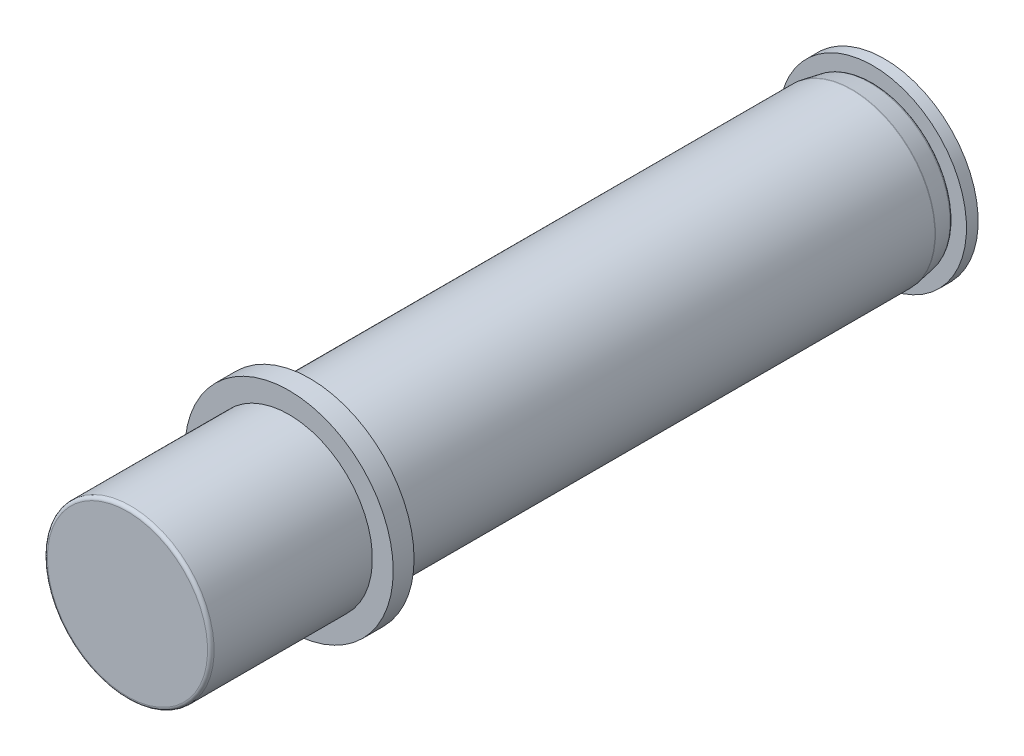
ISO-10303-21;
HEADER;
FILE_DESCRIPTION(('STEP AP214'),'2;1');
FILE_NAME('part.step','',(''),(''),'','','');
FILE_SCHEMA(('AUTOMOTIVE_DESIGN { 1 0 10303 214 1 1 1 1 }'));
ENDSEC;
DATA;
#1=APPLICATION_CONTEXT('core data for automotive mechanical design processes');
#2=APPLICATION_PROTOCOL_DEFINITION('international standard','automotive_design',2000,#1);
#3=PRODUCT_CONTEXT('',#1,'mechanical');
#4=PRODUCT('Part','Part','',(#3));
#5=PRODUCT_RELATED_PRODUCT_CATEGORY('part','',(#4));
#6=PRODUCT_DEFINITION_FORMATION('','',#4);
#7=PRODUCT_DEFINITION_CONTEXT('part definition',#1,'design');
#8=PRODUCT_DEFINITION('design','',#6,#7);
#9=PRODUCT_DEFINITION_SHAPE('','',#8);
#10=(LENGTH_UNIT() NAMED_UNIT(*) SI_UNIT(.MILLI.,.METRE.));
#11=(NAMED_UNIT(*) PLANE_ANGLE_UNIT() SI_UNIT($,.RADIAN.));
#12=(NAMED_UNIT(*) SI_UNIT($,.STERADIAN.) SOLID_ANGLE_UNIT());
#13=UNCERTAINTY_MEASURE_WITH_UNIT(LENGTH_MEASURE(1.E-05),#10,'distance_accuracy_value','');
#14=(GEOMETRIC_REPRESENTATION_CONTEXT(3) GLOBAL_UNCERTAINTY_ASSIGNED_CONTEXT((#13)) GLOBAL_UNIT_ASSIGNED_CONTEXT((#10,
#11,#12)) REPRESENTATION_CONTEXT('',''));
#15=CARTESIAN_POINT('',(0.,0.,0.));
#16=DIRECTION('',(0.,0.,1.));
#17=DIRECTION('',(1.,0.,0.));
#18=AXIS2_PLACEMENT_3D('',#15,#16,#17);
#19=CARTESIAN_POINT('',(0.,0.,-181.356));
#20=DIRECTION('',(0.,0.,-1.));
#21=DIRECTION('',(-1.,0.,0.));
#22=AXIS2_PLACEMENT_3D('',#19,#20,#21);
#23=PLANE('',#22);
#24=CARTESIAN_POINT('',(0.,0.,-181.356));
#25=DIRECTION('',(0.,0.,-1.));
#26=DIRECTION('',(-1.,0.,0.));
#27=AXIS2_PLACEMENT_3D('',#24,#25,#26);
#28=CIRCLE('',#27,28.575);
#29=CARTESIAN_POINT('',(-28.575,0.,-181.356));
#30=VERTEX_POINT('',#29);
#31=EDGE_CURVE('E141',#30,#30,#28,.T.);
#32=ORIENTED_EDGE('',*,*,#31,.T.);
#33=EDGE_LOOP('',(#32));
#34=FACE_BOUND('',#33,.T.);
#35=DIRECTION('',(-0.5,-0.866025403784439,0.));
#36=VECTOR('',#35,1.);
#37=CARTESIAN_POINT('',(8.2488919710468,0.,-181.356));
#38=LINE('',#37,#36);
#39=CARTESIAN_POINT('',(8.2488919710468,0.,-181.356));
#40=VERTEX_POINT('',#39);
#41=CARTESIAN_POINT('',(4.12444598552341,-7.14375,-181.356));
#42=VERTEX_POINT('',#41);
#43=EDGE_CURVE('E538',#40,#42,#38,.T.);
#44=ORIENTED_EDGE('',*,*,#43,.F.);
#45=DIRECTION('',(0.5,-0.866025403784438,0.));
#46=VECTOR('',#45,1.);
#47=CARTESIAN_POINT('',(4.1244459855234,7.14375,-181.356));
#48=LINE('',#47,#46);
#49=CARTESIAN_POINT('',(4.1244459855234,7.14375,-181.356));
#50=VERTEX_POINT('',#49);
#51=EDGE_CURVE('E135',#50,#40,#48,.T.);
#52=ORIENTED_EDGE('',*,*,#51,.F.);
#53=DIRECTION('',(1.,0.,0.));
#54=VECTOR('',#53,1.);
#55=CARTESIAN_POINT('',(-4.12444598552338,7.14375,-181.356));
#56=LINE('',#55,#54);
#57=CARTESIAN_POINT('',(-4.12444598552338,7.14375,-181.356));
#58=VERTEX_POINT('',#57);
#59=EDGE_CURVE('E531',#58,#50,#56,.T.);
#60=ORIENTED_EDGE('',*,*,#59,.F.);
#61=DIRECTION('',(0.5,0.866025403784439,0.));
#62=VECTOR('',#61,1.);
#63=CARTESIAN_POINT('',(-8.24889197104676,0.,-181.356));
#64=LINE('',#63,#62);
#65=CARTESIAN_POINT('',(-8.24889197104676,0.,-181.356));
#66=VERTEX_POINT('',#65);
#67=EDGE_CURVE('E533',#66,#58,#64,.T.);
#68=ORIENTED_EDGE('',*,*,#67,.F.);
#69=DIRECTION('',(-0.5,0.866025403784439,0.));
#70=VECTOR('',#69,1.);
#71=CARTESIAN_POINT('',(-4.12444598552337,-7.14375,-181.356));
#72=LINE('',#71,#70);
#73=CARTESIAN_POINT('',(-4.12444598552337,-7.14375,-181.356));
#74=VERTEX_POINT('',#73);
#75=EDGE_CURVE('E535',#74,#66,#72,.T.);
#76=ORIENTED_EDGE('',*,*,#75,.F.);
#77=DIRECTION('',(-1.,0.,0.));
#78=VECTOR('',#77,1.);
#79=CARTESIAN_POINT('',(4.12444598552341,-7.14375,-181.356));
#80=LINE('',#79,#78);
#81=EDGE_CURVE('E525',#42,#74,#80,.T.);
#82=ORIENTED_EDGE('',*,*,#81,.F.);
#83=EDGE_LOOP('',(#44,#52,#60,#68,#76,#82));
#84=FACE_BOUND('',#83,.T.);
#85=ADVANCED_FACE('F39',(#34,#84),#23,.T.);
#86=CARTESIAN_POINT('',(0.,0.,-176.8));
#87=DIRECTION('',(0.,0.,-1.));
#88=DIRECTION('',(-1.,0.,0.));
#89=AXIS2_PLACEMENT_3D('',#86,#87,#88);
#90=TOROIDAL_SURFACE('',#89,23.441224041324,1.00000000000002);
#91=CARTESIAN_POINT('',(0.,0.,-177.8));
#92=DIRECTION('',(0.,0.,-1.));
#93=DIRECTION('',(-1.,0.,0.));
#94=AXIS2_PLACEMENT_3D('',#91,#92,#93);
#95=CIRCLE('',#94,23.441224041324);
#96=CARTESIAN_POINT('',(-23.4412240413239,0.,-177.8));
#97=VERTEX_POINT('',#96);
#98=EDGE_CURVE('E176',#97,#97,#95,.T.);
#99=ORIENTED_EDGE('',*,*,#98,.F.);
#100=EDGE_LOOP('',(#99));
#101=FACE_BOUND('',#100,.T.);
#102=CARTESIAN_POINT('',(0.,0.,-176.973648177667));
#103=DIRECTION('',(0.,0.,-1.));
#104=DIRECTION('',(-1.,0.,0.));
#105=AXIS2_PLACEMENT_3D('',#102,#103,#104);
#106=CIRCLE('',#105,24.4260317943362);
#107=CARTESIAN_POINT('',(-24.4260317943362,0.,-176.973648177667));
#108=VERTEX_POINT('',#107);
#109=EDGE_CURVE('E173',#108,#108,#106,.T.);
#110=ORIENTED_EDGE('',*,*,#109,.T.);
#111=EDGE_LOOP('',(#110));
#112=FACE_BOUND('',#111,.T.);
#113=ADVANCED_FACE('F41',(#101,#112),#90,.T.);
#114=CARTESIAN_POINT('',(0.,0.,-171.536159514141));
#115=DIRECTION('',(0.,0.,1.));
#116=DIRECTION('',(1.,0.,0.));
#117=AXIS2_PLACEMENT_3D('',#114,#115,#116);
#118=CONICAL_SURFACE('',#117,25.3848077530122,0.174532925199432);
#119=ORIENTED_EDGE('',*,*,#109,.F.);
#120=EDGE_LOOP('',(#119));
#121=FACE_BOUND('',#120,.T.);
#122=CARTESIAN_POINT('',(0.,0.,-171.536159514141));
#123=DIRECTION('',(0.,0.,-1.));
#124=DIRECTION('',(-1.,0.,0.));
#125=AXIS2_PLACEMENT_3D('',#122,#123,#124);
#126=CIRCLE('',#125,25.3848077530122);
#127=CARTESIAN_POINT('',(-25.3848077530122,0.,-171.536159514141));
#128=VERTEX_POINT('',#127);
#129=EDGE_CURVE('E170',#128,#128,#126,.T.);
#130=ORIENTED_EDGE('',*,*,#129,.T.);
#131=EDGE_LOOP('',(#130));
#132=FACE_BOUND('',#131,.T.);
#133=ADVANCED_FACE('F307',(#121,#132),#118,.T.);
#134=CARTESIAN_POINT('',(0.,0.,-171.362511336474));
#135=DIRECTION('',(0.,0.,-1.));
#136=DIRECTION('',(-1.,0.,0.));
#137=AXIS2_PLACEMENT_3D('',#134,#135,#136);
#138=TOROIDAL_SURFACE('',#137,24.4,1.);
#139=ORIENTED_EDGE('',*,*,#129,.F.);
#140=EDGE_LOOP('',(#139));
#141=FACE_BOUND('',#140,.T.);
#142=CARTESIAN_POINT('',(0.,0.,-171.362511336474));
#143=DIRECTION('',(0.,0.,-1.));
#144=DIRECTION('',(-1.,0.,0.));
#145=AXIS2_PLACEMENT_3D('',#142,#143,#144);
#146=CIRCLE('',#145,25.4);
#147=CARTESIAN_POINT('',(-25.4,0.,-171.362511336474));
#148=VERTEX_POINT('',#147);
#149=EDGE_CURVE('E167',#148,#148,#146,.T.);
#150=ORIENTED_EDGE('',*,*,#149,.T.);
#151=EDGE_LOOP('',(#150));
#152=FACE_BOUND('',#151,.T.);
#153=ADVANCED_FACE('F304',(#141,#152),#138,.T.);
#154=CARTESIAN_POINT('',(0.,0.,-41.5372037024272));
#155=DIRECTION('',(0.,0.,-1.));
#156=DIRECTION('',(-1.,0.,0.));
#157=AXIS2_PLACEMENT_3D('',#154,#155,#156);
#158=CYLINDRICAL_SURFACE('',#157,25.4);
#159=ORIENTED_EDGE('',*,*,#149,.F.);
#160=EDGE_LOOP('',(#159));
#161=FACE_BOUND('',#160,.T.);
#162=CARTESIAN_POINT('',(0.,0.,-6.35));
#163=DIRECTION('',(0.,0.,-1.));
#164=DIRECTION('',(-1.,0.,0.));
#165=AXIS2_PLACEMENT_3D('',#162,#163,#164);
#166=CIRCLE('',#165,25.4);
#167=CARTESIAN_POINT('',(-25.4,0.,-6.35));
#168=VERTEX_POINT('',#167);
#169=EDGE_CURVE('E164',#168,#168,#166,.T.);
#170=ORIENTED_EDGE('',*,*,#169,.T.);
#171=EDGE_LOOP('',(#170));
#172=FACE_BOUND('',#171,.T.);
#173=ADVANCED_FACE('F300',(#161,#172),#158,.T.);
#174=CARTESIAN_POINT('',(-25.4,0.,-6.35));
#175=DIRECTION('',(0.,0.,1.));
#176=DIRECTION('',(1.,0.,0.));
#177=AXIS2_PLACEMENT_3D('',#174,#175,#176);
#178=PLANE('',#177);
#179=ORIENTED_EDGE('',*,*,#169,.F.);
#180=EDGE_LOOP('',(#179));
#181=FACE_BOUND('',#180,.T.);
#182=CARTESIAN_POINT('',(0.,0.,-6.34999999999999));
#183=DIRECTION('',(0.,0.,-1.));
#184=DIRECTION('',(-1.,0.,0.));
#185=AXIS2_PLACEMENT_3D('',#182,#183,#184);
#186=CIRCLE('',#185,31.75);
#187=CARTESIAN_POINT('',(-31.75,0.,-6.35));
#188=VERTEX_POINT('',#187);
#189=EDGE_CURVE('E161',#188,#188,#186,.T.);
#190=ORIENTED_EDGE('',*,*,#189,.T.);
#191=EDGE_LOOP('',(#190));
#192=FACE_BOUND('',#191,.T.);
#193=ADVANCED_FACE('F296',(#181,#192),#178,.F.);
#194=CARTESIAN_POINT('',(0.,0.,-41.5372037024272));
#195=DIRECTION('',(0.,0.,-1.));
#196=DIRECTION('',(-1.,0.,0.));
#197=AXIS2_PLACEMENT_3D('',#194,#195,#196);
#198=CYLINDRICAL_SURFACE('',#197,31.75);
#199=ORIENTED_EDGE('',*,*,#189,.F.);
#200=EDGE_LOOP('',(#199));
#201=FACE_BOUND('',#200,.T.);
#202=CARTESIAN_POINT('',(0.,0.,0.));
#203=DIRECTION('',(0.,0.,-1.));
#204=DIRECTION('',(-1.,0.,0.));
#205=AXIS2_PLACEMENT_3D('',#202,#203,#204);
#206=CIRCLE('',#205,31.75);
#207=CARTESIAN_POINT('',(-31.75,0.,0.));
#208=VERTEX_POINT('',#207);
#209=EDGE_CURVE('E158',#208,#208,#206,.T.);
#210=ORIENTED_EDGE('',*,*,#209,.T.);
#211=EDGE_LOOP('',(#210));
#212=FACE_BOUND('',#211,.T.);
#213=ADVANCED_FACE('F292',(#201,#212),#198,.T.);
#214=CARTESIAN_POINT('',(-31.75,0.,0.));
#215=DIRECTION('',(0.,0.,-1.));
#216=DIRECTION('',(-1.,0.,0.));
#217=AXIS2_PLACEMENT_3D('',#214,#215,#216);
#218=PLANE('',#217);
#219=ORIENTED_EDGE('',*,*,#209,.F.);
#220=EDGE_LOOP('',(#219));
#221=FACE_BOUND('',#220,.T.);
#222=CARTESIAN_POINT('',(0.,0.,0.));
#223=DIRECTION('',(0.,0.,-1.));
#224=DIRECTION('',(-1.,0.,0.));
#225=AXIS2_PLACEMENT_3D('',#222,#223,#224);
#226=CIRCLE('',#225,25.4);
#227=CARTESIAN_POINT('',(-25.4,0.,0.));
#228=VERTEX_POINT('',#227);
#229=EDGE_CURVE('E155',#228,#228,#226,.T.);
#230=ORIENTED_EDGE('',*,*,#229,.T.);
#231=EDGE_LOOP('',(#230));
#232=FACE_BOUND('',#231,.T.);
#233=ADVANCED_FACE('F288',(#221,#232),#218,.F.);
#234=CARTESIAN_POINT('',(0.,0.,-41.5372037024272));
#235=DIRECTION('',(0.,0.,-1.));
#236=DIRECTION('',(-1.,0.,0.));
#237=AXIS2_PLACEMENT_3D('',#234,#235,#236);
#238=CYLINDRICAL_SURFACE('',#237,25.4);
#239=ORIENTED_EDGE('',*,*,#229,.F.);
#240=EDGE_LOOP('',(#239));
#241=FACE_BOUND('',#240,.T.);
#242=CARTESIAN_POINT('',(0.,0.,48.2125));
#243=DIRECTION('',(0.,0.,-1.));
#244=DIRECTION('',(-1.,0.,0.));
#245=AXIS2_PLACEMENT_3D('',#242,#243,#244);
#246=CIRCLE('',#245,25.4);
#247=CARTESIAN_POINT('',(-25.4,0.,48.2125));
#248=VERTEX_POINT('',#247);
#249=EDGE_CURVE('E152',#248,#248,#246,.T.);
#250=ORIENTED_EDGE('',*,*,#249,.T.);
#251=EDGE_LOOP('',(#250));
#252=FACE_BOUND('',#251,.T.);
#253=ADVANCED_FACE('F284',(#241,#252),#238,.T.);
#254=CARTESIAN_POINT('',(0.,0.,48.2125));
#255=DIRECTION('',(0.,0.,-1.));
#256=DIRECTION('',(-1.,0.,0.));
#257=AXIS2_PLACEMENT_3D('',#254,#255,#256);
#258=TOROIDAL_SURFACE('',#257,24.4,0.999999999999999);
#259=ORIENTED_EDGE('',*,*,#249,.F.);
#260=EDGE_LOOP('',(#259));
#261=FACE_BOUND('',#260,.T.);
#262=CARTESIAN_POINT('',(0.,0.,49.2125));
#263=DIRECTION('',(0.,0.,-1.));
#264=DIRECTION('',(-1.,0.,0.));
#265=AXIS2_PLACEMENT_3D('',#262,#263,#264);
#266=CIRCLE('',#265,24.4);
#267=CARTESIAN_POINT('',(-24.4,0.,49.2125));
#268=VERTEX_POINT('',#267);
#269=EDGE_CURVE('E148',#268,#268,#266,.T.);
#270=ORIENTED_EDGE('',*,*,#269,.T.);
#271=EDGE_LOOP('',(#270));
#272=FACE_BOUND('',#271,.T.);
#273=ADVANCED_FACE('F280',(#261,#272),#258,.T.);
#274=CARTESIAN_POINT('',(-24.4,0.,49.2125));
#275=DIRECTION('',(0.,0.,-1.));
#276=DIRECTION('',(-1.,0.,0.));
#277=AXIS2_PLACEMENT_3D('',#274,#275,#276);
#278=PLANE('',#277);
#279=ORIENTED_EDGE('',*,*,#269,.F.);
#280=EDGE_LOOP('',(#279));
#281=FACE_BOUND('',#280,.T.);
#282=ADVANCED_FACE('F273',(#281),#278,.F.);
#283=CARTESIAN_POINT('',(0.,0.,-177.8));
#284=DIRECTION('',(0.,0.,-1.));
#285=DIRECTION('',(-1.,0.,0.));
#286=AXIS2_PLACEMENT_3D('',#283,#284,#285);
#287=PLANE('',#286);
#288=CARTESIAN_POINT('',(0.,0.,-177.8));
#289=DIRECTION('',(0.,0.,-1.));
#290=DIRECTION('',(-1.,0.,0.));
#291=AXIS2_PLACEMENT_3D('',#288,#289,#290);
#292=CIRCLE('',#291,28.575);
#293=CARTESIAN_POINT('',(-28.575,0.,-177.8));
#294=VERTEX_POINT('',#293);
#295=EDGE_CURVE('E137',#294,#294,#292,.T.);
#296=ORIENTED_EDGE('',*,*,#295,.F.);
#297=EDGE_LOOP('',(#296));
#298=FACE_BOUND('',#297,.T.);
#299=ORIENTED_EDGE('',*,*,#98,.T.);
#300=EDGE_LOOP('',(#299));
#301=FACE_BOUND('',#300,.T.);
#302=ADVANCED_FACE('F270',(#298,#301),#287,.F.);
#303=CARTESIAN_POINT('',(0.,0.,-181.356));
#304=DIRECTION('',(0.,0.,1.));
#305=DIRECTION('',(1.,0.,0.));
#306=AXIS2_PLACEMENT_3D('',#303,#304,#305);
#307=CYLINDRICAL_SURFACE('',#306,28.575);
#308=ORIENTED_EDGE('',*,*,#31,.F.);
#309=EDGE_LOOP('',(#308));
#310=FACE_BOUND('',#309,.T.);
#311=ORIENTED_EDGE('',*,*,#295,.T.);
#312=EDGE_LOOP('',(#311));
#313=FACE_BOUND('',#312,.T.);
#314=ADVANCED_FACE('F266',(#310,#313),#307,.T.);
#315=CARTESIAN_POINT('',(4.12444598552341,7.14375,-187.325));
#316=DIRECTION('',(-0.866025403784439,-0.5,0.));
#317=DIRECTION('',(0.5,-0.866025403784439,0.));
#318=AXIS2_PLACEMENT_3D('',#315,#316,#317);
#319=PLANE('',#318);
#320=DIRECTION('',(0.,0.,1.));
#321=VECTOR('',#320,1.);
#322=CARTESIAN_POINT('',(8.2488919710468,0.,-187.325));
#323=LINE('',#322,#321);
#324=CARTESIAN_POINT('',(8.2488919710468,0.,-186.219858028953));
#325=VERTEX_POINT('',#324);
#326=EDGE_CURVE('E128',#325,#40,#323,.T.);
#327=ORIENTED_EDGE('',*,*,#326,.F.);
#328=CARTESIAN_POINT('',(8.24889195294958,3.13453060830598E-08,-186.219658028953));
#329=CARTESIAN_POINT('',(8.24893665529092,-7.73953811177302E-05,-186.252757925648));
#330=CARTESIAN_POINT('',(8.2474192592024,0.00255081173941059,-186.285775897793));
#331=CARTESIAN_POINT('',(8.24159732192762,0.0126347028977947,-186.350535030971));
#332=CARTESIAN_POINT('',(8.23731677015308,0.0200488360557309,-186.382284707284));
#333=CARTESIAN_POINT('',(8.22631101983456,0.0391113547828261,-186.443902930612));
#334=CARTESIAN_POINT('',(8.2195927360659,0.0507477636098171,-186.473776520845));
#335=CARTESIAN_POINT('',(8.20413507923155,0.0775212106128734,-186.531400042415));
#336=CARTESIAN_POINT('',(8.19539115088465,0.0926661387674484,-186.559144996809));
#337=CARTESIAN_POINT('',(8.1700121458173,0.136623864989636,-186.629808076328));
#338=CARTESIAN_POINT('',(8.15196984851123,0.167874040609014,-186.670701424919));
#339=CARTESIAN_POINT('',(8.11295341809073,0.235452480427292,-186.746436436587));
#340=CARTESIAN_POINT('',(8.09197141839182,0.271794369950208,-186.781261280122));
#341=CARTESIAN_POINT('',(8.05103325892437,0.34270134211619,-186.841233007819));
#342=CARTESIAN_POINT('',(8.03131841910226,0.376848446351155,-186.867051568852));
#343=CARTESIAN_POINT('',(7.99084351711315,0.446953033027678,-186.915210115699));
#344=CARTESIAN_POINT('',(7.9700826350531,0.482911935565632,-186.937547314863));
#345=CARTESIAN_POINT('',(7.9277875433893,0.556169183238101,-186.979213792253));
#346=CARTESIAN_POINT('',(7.90625218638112,0.593469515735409,-186.998538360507));
#347=CARTESIAN_POINT('',(7.8626473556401,0.668995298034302,-187.034530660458));
#348=CARTESIAN_POINT('',(7.84057806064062,0.707220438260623,-187.051199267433));
#349=CARTESIAN_POINT('',(7.78697088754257,0.800070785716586,-187.088552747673));
#350=CARTESIAN_POINT('',(7.75523689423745,0.855035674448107,-187.108109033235));
#351=CARTESIAN_POINT('',(7.69124235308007,0.965877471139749,-187.143444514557));
#352=CARTESIAN_POINT('',(7.65898155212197,1.02175481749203,-187.159221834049));
#353=CARTESIAN_POINT('',(7.56158169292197,1.1904563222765,-187.201901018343));
#354=CARTESIAN_POINT('',(7.49592749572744,1.30417272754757,-187.224084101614));
#355=CARTESIAN_POINT('',(7.36377865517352,1.53306123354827,-187.259811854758));
#356=CARTESIAN_POINT('',(7.29728152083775,1.64823764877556,-187.273315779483));
#357=CARTESIAN_POINT('',(7.16403542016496,1.87902666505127,-187.294316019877));
#358=CARTESIAN_POINT('',(7.09728636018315,1.99463942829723,-187.301809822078));
#359=CARTESIAN_POINT('',(6.9508625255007,2.24825294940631,-187.313988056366));
#360=CARTESIAN_POINT('',(6.87117288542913,2.38627945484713,-187.317854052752));
#361=CARTESIAN_POINT('',(6.71175869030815,2.66239294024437,-187.32277054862));
#362=CARTESIAN_POINT('',(6.63203413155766,2.80047992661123,-187.323820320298));
#363=CARTESIAN_POINT('',(6.47285356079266,3.07618876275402,-187.324916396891));
#364=CARTESIAN_POINT('',(6.39339755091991,3.21381060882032,-187.324966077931));
#365=CARTESIAN_POINT('',(6.23449324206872,3.4890409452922,-187.325015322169));
#366=CARTESIAN_POINT('',(6.15504494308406,3.62664943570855,-187.325014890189));
#367=CARTESIAN_POINT('',(6.02177357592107,3.85748221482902,-187.324980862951));
#368=CARTESIAN_POINT('',(5.96795051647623,3.95070648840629,-187.324958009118));
#369=CARTESIAN_POINT('',(5.86030463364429,4.1371546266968,-187.324651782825));
#370=CARTESIAN_POINT('',(5.80648181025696,4.23037849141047,-187.324368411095));
#371=CARTESIAN_POINT('',(5.69883146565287,4.41683435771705,-187.32313207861));
#372=CARTESIAN_POINT('',(5.64500394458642,4.51006635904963,-187.322179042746));
#373=CARTESIAN_POINT('',(5.53735901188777,4.69651285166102,-187.319006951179));
#374=CARTESIAN_POINT('',(5.48354159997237,4.78972734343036,-187.316787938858));
#375=CARTESIAN_POINT('',(5.35685060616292,5.00916258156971,-187.309173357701));
#376=CARTESIAN_POINT('',(5.28398824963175,5.13536388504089,-187.302930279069));
#377=CARTESIAN_POINT('',(5.13829981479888,5.38770365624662,-187.284235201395));
#378=CARTESIAN_POINT('',(5.06547404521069,5.51384158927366,-187.271771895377));
#379=CARTESIAN_POINT('',(4.9517369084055,5.71084008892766,-187.244695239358));
#380=CARTESIAN_POINT('',(4.91063496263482,5.78203074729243,-187.23333891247));
#381=CARTESIAN_POINT('',(4.82875330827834,5.92385393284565,-187.206713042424));
#382=CARTESIAN_POINT('',(4.78797350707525,5.99448662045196,-187.191444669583));
#383=CARTESIAN_POINT('',(4.70707092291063,6.1346140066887,-187.156063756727));
#384=CARTESIAN_POINT('',(4.66694644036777,6.20411164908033,-187.135967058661));
#385=CARTESIAN_POINT('',(4.58760154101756,6.34154104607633,-187.08967187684));
#386=CARTESIAN_POINT('',(4.54838026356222,6.40947429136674,-187.063479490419));
#387=CARTESIAN_POINT('',(4.48181488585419,6.52476890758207,-187.011463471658));
#388=CARTESIAN_POINT('',(4.45412091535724,6.57273627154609,-186.987446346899));
#389=CARTESIAN_POINT('',(4.39988598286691,6.66667393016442,-186.934419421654));
#390=CARTESIAN_POINT('',(4.37334656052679,6.71264155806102,-186.905403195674));
#391=CARTESIAN_POINT('',(4.32186330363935,6.80181317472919,-186.84114040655));
#392=CARTESIAN_POINT('',(4.29693579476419,6.8449888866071,-186.805840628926));
#393=CARTESIAN_POINT('',(4.25003212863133,6.92622841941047,-186.728084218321));
#394=CARTESIAN_POINT('',(4.22804826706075,6.96430558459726,-186.685646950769));
#395=CARTESIAN_POINT('',(4.19642269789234,7.01908267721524,-186.61092536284));
#396=CARTESIAN_POINT('',(4.18531180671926,7.03832730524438,-186.581138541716));
#397=CARTESIAN_POINT('',(4.16537762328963,7.0728543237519,-186.518608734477));
#398=CARTESIAN_POINT('',(4.15655280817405,7.08813935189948,-186.485867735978));
#399=CARTESIAN_POINT('',(4.14264555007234,7.11222742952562,-186.421684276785));
#400=CARTESIAN_POINT('',(4.13725286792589,7.12156782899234,-186.390513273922));
#401=CARTESIAN_POINT('',(4.12917285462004,7.1355628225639,-186.326833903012));
#402=CARTESIAN_POINT('',(4.12647894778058,7.1402288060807,-186.294328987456));
#403=CARTESIAN_POINT('',(4.12470486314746,7.1433016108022,-186.247663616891));
#404=CARTESIAN_POINT('',(4.12443867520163,7.14376266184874,-186.233658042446));
#405=CARTESIAN_POINT('',(4.12444600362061,7.14374996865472,-186.219658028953));
#406=B_SPLINE_CURVE_WITH_KNOTS('',3,(#328,#329,#330,#331,#332,#333,#334,#335,#336,#337,#338,
#339,#340,#341,#342,#343,#344,#345,#346,#347,#348,#349,#350,#351,#352,#353,#354,#355,#356,#357,
#358,#359,#360,#361,#362,#363,#364,#365,#366,#367,#368,#369,#370,#371,#372,#373,#374,#375,#376,
#377,#378,#379,#380,#381,#382,#383,#384,#385,#386,#387,#388,#389,#390,#391,#392,#393,#394,#395,
#396,#397,#398,#399,#400,#401,#402,#403,#404,#405),.UNSPECIFIED.,.F.,.F.,(4,2,2,2,2,2,2,2,2,2,2,
2,2,2,2,2,2,2,2,2,2,2,2,2,2,2,2,2,2,2,2,2,2,2,2,2,2,2,4),(0.,0.0990278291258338,
0.19720726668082,0.29511036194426,0.393235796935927,0.555910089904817,0.719028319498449,
0.860216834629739,1.0015177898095,1.14303748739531,1.28451045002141,1.48359355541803,
1.6827753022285,2.08178073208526,2.48264590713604,2.88367863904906,3.36190592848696,
3.84025679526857,4.31699256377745,4.79368245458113,5.11662076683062,5.43955817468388,
5.76253180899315,6.08549437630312,6.52300446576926,6.96131276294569,7.21019547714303,
7.45900382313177,7.70700670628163,7.95476257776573,8.13568471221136,8.31684115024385,
8.49961187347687,8.68189447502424,8.79306748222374,8.90416624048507,9.00270860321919,
9.10101027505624,9.14301656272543),.UNSPECIFIED.);
#407=CARTESIAN_POINT('',(6.18666897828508,3.571875,-187.325));
#408=VERTEX_POINT('',#407);
#409=EDGE_CURVE('E111',#325,#408,#406,.T.);
#410=ORIENTED_EDGE('',*,*,#409,.T.);
#411=CARTESIAN_POINT('',(4.12444598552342,7.14375,-186.219858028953));
#412=VERTEX_POINT('',#411);
#413=EDGE_CURVE('E121',#408,#412,#406,.T.);
#414=ORIENTED_EDGE('',*,*,#413,.T.);
#415=DIRECTION('',(0.,0.,1.));
#416=VECTOR('',#415,1.);
#417=CARTESIAN_POINT('',(4.12444598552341,7.14375,-187.325));
#418=LINE('',#417,#416);
#419=EDGE_CURVE('E518',#412,#50,#418,.T.);
#420=ORIENTED_EDGE('',*,*,#419,.T.);
#421=ORIENTED_EDGE('',*,*,#51,.T.);
#422=EDGE_LOOP('',(#327,#410,#414,#420,#421));
#423=FACE_BOUND('',#422,.T.);
#424=ADVANCED_FACE('F133',(#423),#319,.F.);
#425=CARTESIAN_POINT('',(8.2488919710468,0.,-187.325));
#426=DIRECTION('',(-0.866025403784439,0.5,0.));
#427=DIRECTION('',(-0.5,-0.866025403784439,0.));
#428=AXIS2_PLACEMENT_3D('',#425,#426,#427);
#429=PLANE('',#428);
#430=DIRECTION('',(0.,0.,1.));
#431=VECTOR('',#430,1.);
#432=CARTESIAN_POINT('',(4.12444598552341,-7.14375,-187.325));
#433=LINE('',#432,#431);
#434=CARTESIAN_POINT('',(4.12444598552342,-7.14375,-186.219858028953));
#435=VERTEX_POINT('',#434);
#436=EDGE_CURVE('E138',#435,#42,#433,.T.);
#437=ORIENTED_EDGE('',*,*,#436,.F.);
#438=CARTESIAN_POINT('',(4.12444600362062,-7.14374996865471,-186.219658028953));
#439=CARTESIAN_POINT('',(4.12440130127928,-7.14382739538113,-186.252757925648));
#440=CARTESIAN_POINT('',(4.1259186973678,-7.1411991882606,-186.285775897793));
#441=CARTESIAN_POINT('',(4.13174063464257,-7.13111529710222,-186.350535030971));
#442=CARTESIAN_POINT('',(4.13602118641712,-7.12370116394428,-186.382284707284));
#443=CARTESIAN_POINT('',(4.14702693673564,-7.10463864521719,-186.443902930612));
#444=CARTESIAN_POINT('',(4.1537452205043,-7.09300223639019,-186.473776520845));
#445=CARTESIAN_POINT('',(4.16920287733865,-7.06622878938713,-186.531400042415));
#446=CARTESIAN_POINT('',(4.17794680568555,-7.05108386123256,-186.559144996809));
#447=CARTESIAN_POINT('',(4.20332581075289,-7.00712613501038,-186.629808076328));
#448=CARTESIAN_POINT('',(4.22136810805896,-6.975875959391,-186.670701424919));
#449=CARTESIAN_POINT('',(4.26038453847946,-6.90829751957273,-186.746436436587));
#450=CARTESIAN_POINT('',(4.28136653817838,-6.87195563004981,-186.781261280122));
#451=CARTESIAN_POINT('',(4.32230469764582,-6.80104865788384,-186.841233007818));
#452=CARTESIAN_POINT('',(4.34201953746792,-6.76690155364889,-186.867051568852));
#453=CARTESIAN_POINT('',(4.38249443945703,-6.69679696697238,-186.915210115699));
#454=CARTESIAN_POINT('',(4.40325532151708,-6.66083806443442,-186.937547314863));
#455=CARTESIAN_POINT('',(4.44555041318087,-6.58758081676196,-186.979213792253));
#456=CARTESIAN_POINT('',(4.46708577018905,-6.55028048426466,-186.998538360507));
#457=CARTESIAN_POINT('',(4.51069060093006,-6.47475470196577,-187.034530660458));
#458=CARTESIAN_POINT('',(4.53275989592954,-6.43652956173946,-187.051199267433));
#459=CARTESIAN_POINT('',(4.58636706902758,-6.34367921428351,-187.088552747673));
#460=CARTESIAN_POINT('',(4.6181010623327,-6.288714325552,-187.108109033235));
#461=CARTESIAN_POINT('',(4.68209560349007,-6.17787252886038,-187.143444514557));
#462=CARTESIAN_POINT('',(4.71435640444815,-6.1219951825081,-187.159221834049));
#463=CARTESIAN_POINT('',(4.81175626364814,-5.95329367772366,-187.201901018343));
#464=CARTESIAN_POINT('',(4.87741046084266,-5.83957727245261,-187.224084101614));
#465=CARTESIAN_POINT('',(5.00955930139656,-5.61068876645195,-187.259811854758));
#466=CARTESIAN_POINT('',(5.07605643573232,-5.49551235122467,-187.273315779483));
#467=CARTESIAN_POINT('',(5.20930253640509,-5.264723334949,-187.294316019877));
#468=CARTESIAN_POINT('',(5.27605159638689,-5.14911057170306,-187.301809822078));
#469=CARTESIAN_POINT('',(5.42247543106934,-4.89549705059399,-187.313988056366));
#470=CARTESIAN_POINT('',(5.5021650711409,-4.75747054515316,-187.317854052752));
#471=CARTESIAN_POINT('',(5.6615792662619,-4.48135705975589,-187.32277054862));
#472=CARTESIAN_POINT('',(5.7413038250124,-4.34327007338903,-187.323820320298));
#473=CARTESIAN_POINT('',(5.9004843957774,-4.06756123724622,-187.324916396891));
#474=CARTESIAN_POINT('',(5.97994040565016,-3.92993939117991,-187.324966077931));
#475=CARTESIAN_POINT('',(6.13884471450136,-3.65470905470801,-187.325015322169));
#476=CARTESIAN_POINT('',(6.21829301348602,-3.51710056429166,-187.325014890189));
#477=CARTESIAN_POINT('',(6.35156438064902,-3.28626778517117,-187.324980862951));
#478=CARTESIAN_POINT('',(6.40538744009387,-3.1930435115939,-187.324958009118));
#479=CARTESIAN_POINT('',(6.51303332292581,-3.00659537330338,-187.324651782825));
#480=CARTESIAN_POINT('',(6.56685614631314,-2.91337150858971,-187.324368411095));
#481=CARTESIAN_POINT('',(6.67450649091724,-2.72691564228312,-187.32313207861));
#482=CARTESIAN_POINT('',(6.72833401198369,-2.63368364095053,-187.322179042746));
#483=CARTESIAN_POINT('',(6.83597894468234,-2.44723714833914,-187.319006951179));
#484=CARTESIAN_POINT('',(6.88979635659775,-2.35402265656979,-187.316787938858));
#485=CARTESIAN_POINT('',(7.0164873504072,-2.13458741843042,-187.309173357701));
#486=CARTESIAN_POINT('',(7.08934970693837,-2.00838611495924,-187.302930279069));
#487=CARTESIAN_POINT('',(7.23503814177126,-1.75604634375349,-187.284235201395));
#488=CARTESIAN_POINT('',(7.30786391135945,-1.62990841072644,-187.271771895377));
#489=CARTESIAN_POINT('',(7.42160104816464,-1.43290991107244,-187.244695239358));
#490=CARTESIAN_POINT('',(7.46270299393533,-1.36171925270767,-187.23333891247));
#491=CARTESIAN_POINT('',(7.54458464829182,-1.21989606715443,-187.206713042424));
#492=CARTESIAN_POINT('',(7.58536444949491,-1.14926337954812,-187.191444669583));
#493=CARTESIAN_POINT('',(7.66626703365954,-1.00913599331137,-187.156063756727));
#494=CARTESIAN_POINT('',(7.70639151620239,-0.939638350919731,-187.135967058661));
#495=CARTESIAN_POINT('',(7.78573641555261,-0.802208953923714,-187.08967187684));
#496=CARTESIAN_POINT('',(7.82495769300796,-0.734275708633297,-187.063479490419));
#497=CARTESIAN_POINT('',(7.891523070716,-0.618981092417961,-187.011463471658));
#498=CARTESIAN_POINT('',(7.91921704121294,-0.57101372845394,-186.987446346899));
#499=CARTESIAN_POINT('',(7.97345197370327,-0.477076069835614,-186.934419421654));
#500=CARTESIAN_POINT('',(7.99999139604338,-0.431108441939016,-186.905403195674));
#501=CARTESIAN_POINT('',(8.05147465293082,-0.341936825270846,-186.84114040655));
#502=CARTESIAN_POINT('',(8.07640216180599,-0.298761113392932,-186.805840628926));
#503=CARTESIAN_POINT('',(8.12330582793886,-0.217521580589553,-186.728084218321));
#504=CARTESIAN_POINT('',(8.14528968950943,-0.179444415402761,-186.685646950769));
#505=CARTESIAN_POINT('',(8.17691525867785,-0.124667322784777,-186.61092536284));
#506=CARTESIAN_POINT('',(8.18802614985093,-0.105422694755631,-186.581138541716));
#507=CARTESIAN_POINT('',(8.20796033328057,-0.0708956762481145,-186.518608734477));
#508=CARTESIAN_POINT('',(8.21678514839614,-0.0556106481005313,-186.485867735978));
#509=CARTESIAN_POINT('',(8.23069240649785,-0.0315225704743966,-186.421684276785));
#510=CARTESIAN_POINT('',(8.2360850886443,-0.0221821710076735,-186.390513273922));
#511=CARTESIAN_POINT('',(8.24416510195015,-0.00818717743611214,-186.326833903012));
#512=CARTESIAN_POINT('',(8.24685900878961,-0.00352119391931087,-186.294328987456));
#513=CARTESIAN_POINT('',(8.24863309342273,-0.00044838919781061,-186.247663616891));
#514=CARTESIAN_POINT('',(8.24889928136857,1.2661848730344E-05,-186.233658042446));
#515=CARTESIAN_POINT('',(8.24889195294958,-3.13452955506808E-08,-186.219658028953));
#516=B_SPLINE_CURVE_WITH_KNOTS('',3,(#438,#439,#440,#441,#442,#443,#444,#445,#446,#447,#448,
#449,#450,#451,#452,#453,#454,#455,#456,#457,#458,#459,#460,#461,#462,#463,#464,#465,#466,#467,
#468,#469,#470,#471,#472,#473,#474,#475,#476,#477,#478,#479,#480,#481,#482,#483,#484,#485,#486,
#487,#488,#489,#490,#491,#492,#493,#494,#495,#496,#497,#498,#499,#500,#501,#502,#503,#504,#505,
#506,#507,#508,#509,#510,#511,#512,#513,#514,#515),.UNSPECIFIED.,.F.,.F.,(4,2,2,2,2,2,2,2,2,2,2,
2,2,2,2,2,2,2,2,2,2,2,2,2,2,2,2,2,2,2,2,2,2,2,2,2,2,2,4),(0.,0.0990278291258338,
0.19720726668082,0.29511036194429,0.393235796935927,0.555910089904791,0.719028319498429,
0.860216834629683,1.00151778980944,1.14303748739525,1.28451045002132,1.4835935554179,
1.68277530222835,2.08178073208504,2.48264590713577,2.88367863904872,3.36190592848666,
3.84025679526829,4.3169925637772,4.79368245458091,5.11662076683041,5.4395581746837,
5.76253180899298,6.08549437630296,6.52300446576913,6.96131276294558,7.21019547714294,
7.4590038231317,7.70700670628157,7.9547625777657,8.13568471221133,8.31684115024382,
8.49961187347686,8.68189447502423,8.79306748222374,8.90416624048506,9.00270860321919,
9.10101027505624,9.14301656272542),.UNSPECIFIED.);
#517=CARTESIAN_POINT('',(6.18666897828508,-3.571875,-187.325));
#518=VERTEX_POINT('',#517);
#519=EDGE_CURVE('E130',#435,#518,#516,.T.);
#520=ORIENTED_EDGE('',*,*,#519,.T.);
#521=EDGE_CURVE('E114',#518,#325,#516,.T.);
#522=ORIENTED_EDGE('',*,*,#521,.T.);
#523=ORIENTED_EDGE('',*,*,#326,.T.);
#524=ORIENTED_EDGE('',*,*,#43,.T.);
#525=EDGE_LOOP('',(#437,#520,#522,#523,#524));
#526=FACE_BOUND('',#525,.T.);
#527=ADVANCED_FACE('F126',(#526),#429,.F.);
#528=CARTESIAN_POINT('',(4.12444598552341,-7.14375,-187.325));
#529=DIRECTION('',(0.,1.,0.));
#530=DIRECTION('',(-1.,0.,0.));
#531=AXIS2_PLACEMENT_3D('',#528,#529,#530);
#532=PLANE('',#531);
#533=CARTESIAN_POINT('',(0.,-7.14375,-187.325));
#534=CARTESIAN_POINT('',(0.184134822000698,-7.14375,-187.325008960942));
#535=CARTESIAN_POINT('',(0.368270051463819,-7.14375,-187.32507213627));
#536=CARTESIAN_POINT('',(0.73658686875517,-7.14375,-187.324516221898));
#537=CARTESIAN_POINT('',(0.920768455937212,-7.14375,-187.32389695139));
#538=CARTESIAN_POINT('',(1.28943422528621,-7.14375,-187.319560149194));
#539=CARTESIAN_POINT('',(1.47391839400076,-7.14375,-187.315837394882));
#540=CARTESIAN_POINT('',(1.75040396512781,-7.14375,-187.3049155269));
#541=CARTESIAN_POINT('',(1.84250374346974,-7.14375,-187.300386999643));
#542=CARTESIAN_POINT('',(2.02654581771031,-7.14375,-187.288873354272));
#543=CARTESIAN_POINT('',(2.11848812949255,-7.14375,-187.281888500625));
#544=CARTESIAN_POINT('',(2.30278507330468,-7.14375,-187.264610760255));
#545=CARTESIAN_POINT('',(2.39513744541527,-7.14375,-187.254292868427));
#546=CARTESIAN_POINT('',(2.5793211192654,-7.14375,-187.229370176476));
#547=CARTESIAN_POINT('',(2.67115216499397,-7.14375,-187.214763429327));
#548=CARTESIAN_POINT('',(2.85366165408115,-7.14375,-187.180050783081));
#549=CARTESIAN_POINT('',(2.94434161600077,-7.14375,-187.159953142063));
#550=CARTESIAN_POINT('',(3.12377436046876,-7.14375,-187.112683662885));
#551=CARTESIAN_POINT('',(3.21252905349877,-7.14375,-187.085519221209));
#552=CARTESIAN_POINT('',(3.38752544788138,-7.14375,-187.021710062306));
#553=CARTESIAN_POINT('',(3.47374235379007,-7.14375,-186.984993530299));
#554=CARTESIAN_POINT('',(3.59817731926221,-7.14375,-186.920746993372));
#555=CARTESIAN_POINT('',(3.63878205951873,-7.14375,-186.897844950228));
#556=CARTESIAN_POINT('',(3.71777060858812,-7.14375,-186.84851342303));
#557=CARTESIAN_POINT('',(3.7561564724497,-7.14375,-186.822087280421));
#558=CARTESIAN_POINT('',(3.82866755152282,-7.14375,-186.766111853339));
#559=CARTESIAN_POINT('',(3.86289008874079,-7.14375,-186.736690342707));
#560=CARTESIAN_POINT('',(3.9273059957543,-7.14375,-186.673598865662));
#561=CARTESIAN_POINT('',(3.95749582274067,-7.14375,-186.639925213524));
#562=CARTESIAN_POINT('',(4.0125400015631,-7.14375,-186.567596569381));
#563=CARTESIAN_POINT('',(4.03731087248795,-7.14375,-186.528876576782));
#564=CARTESIAN_POINT('',(4.0786055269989,-7.14375,-186.447274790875));
#565=CARTESIAN_POINT('',(4.09515768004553,-7.14375,-186.404407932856));
#566=CARTESIAN_POINT('',(4.11438125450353,-7.14375,-186.329628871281));
#567=CARTESIAN_POINT('',(4.11975670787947,-7.14375,-186.298404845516));
#568=CARTESIAN_POINT('',(4.12511945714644,-7.14375,-186.235494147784));
#569=CARTESIAN_POINT('',(4.12510911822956,-7.14375,-186.203807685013));
#570=CARTESIAN_POINT('',(4.11969971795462,-7.14375,-186.140939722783));
#571=CARTESIAN_POINT('',(4.11430599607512,-7.14375,-186.109757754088));
#572=CARTESIAN_POINT('',(4.09858338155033,-7.14375,-186.048670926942));
#573=CARTESIAN_POINT('',(4.08825127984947,-7.14375,-186.018766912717));
#574=CARTESIAN_POINT('',(4.05934676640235,-7.14375,-185.951476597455));
#575=CARTESIAN_POINT('',(4.03919356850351,-7.14375,-185.914771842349));
#576=CARTESIAN_POINT('',(3.99324618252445,-7.14375,-185.845091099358));
#577=CARTESIAN_POINT('',(3.9674403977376,-7.14375,-185.812122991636));
#578=CARTESIAN_POINT('',(3.89703091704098,-7.14375,-185.733530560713));
#579=CARTESIAN_POINT('',(3.84968420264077,-7.14375,-185.69038331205));
#580=CARTESIAN_POINT('',(3.74910520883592,-7.14375,-185.61169535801));
#581=CARTESIAN_POINT('',(3.69586018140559,-7.14375,-185.576171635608));
#582=CARTESIAN_POINT('',(3.58968066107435,-7.14375,-185.513827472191));
#583=CARTESIAN_POINT('',(3.53700146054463,-7.14375,-185.486563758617));
#584=CARTESIAN_POINT('',(3.42949276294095,-7.14375,-185.436604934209));
#585=CARTESIAN_POINT('',(3.37466129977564,-7.14375,-185.413914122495));
#586=CARTESIAN_POINT('',(3.26346471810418,-7.14375,-185.372348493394));
#587=CARTESIAN_POINT('',(3.20709674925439,-7.14375,-185.353481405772));
#588=CARTESIAN_POINT('',(3.09341473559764,-7.14375,-185.319026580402));
#589=CARTESIAN_POINT('',(3.03610121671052,-7.14375,-185.303437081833));
#590=CARTESIAN_POINT('',(2.87773705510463,-7.14375,-185.264399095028));
#591=CARTESIAN_POINT('',(2.77599150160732,-7.14375,-185.243777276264));
#592=CARTESIAN_POINT('',(2.57140096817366,-7.14375,-185.208849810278));
#593=CARTESIAN_POINT('',(2.46855522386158,-7.14375,-185.194548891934));
#594=CARTESIAN_POINT('',(2.2620702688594,-7.14375,-185.170680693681));
#595=CARTESIAN_POINT('',(2.15842971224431,-7.14375,-185.161125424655));
#596=CARTESIAN_POINT('',(1.95088016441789,-7.14375,-185.145548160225));
#597=CARTESIAN_POINT('',(1.84697113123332,-7.14375,-185.139526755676));
#598=CARTESIAN_POINT('',(1.63848619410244,-7.14375,-185.129982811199));
#599=CARTESIAN_POINT('',(1.53390970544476,-7.14375,-185.126473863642));
#600=CARTESIAN_POINT('',(1.32471155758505,-7.14375,-185.121172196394));
#601=CARTESIAN_POINT('',(1.22008989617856,-7.14375,-185.119379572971));
#602=CARTESIAN_POINT('',(1.01099641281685,-7.14375,-185.11684513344));
#603=CARTESIAN_POINT('',(0.906524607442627,-7.14375,-185.116101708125));
#604=CARTESIAN_POINT('',(0.697579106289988,-7.14375,-185.115154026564));
#605=CARTESIAN_POINT('',(0.593105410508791,-7.14375,-185.114949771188));
#606=CARTESIAN_POINT('',(0.38606218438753,-7.14375,-185.114736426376));
#607=CARTESIAN_POINT('',(0.283492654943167,-7.14375,-185.114723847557));
#608=CARTESIAN_POINT('',(0.0783537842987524,-7.14375,-185.114713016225));
#609=CARTESIAN_POINT('',(-0.024215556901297,-7.14375,-185.114714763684));
#610=CARTESIAN_POINT('',(-0.229411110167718,-7.14375,-185.114718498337));
#611=CARTESIAN_POINT('',(-0.332037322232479,-7.14375,-185.114720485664));
#612=CARTESIAN_POINT('',(-0.537289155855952,-7.14375,-185.114869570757));
#613=CARTESIAN_POINT('',(-0.639914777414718,-7.14375,-185.115016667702));
#614=CARTESIAN_POINT('',(-0.84495624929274,-7.14375,-185.115755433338));
#615=CARTESIAN_POINT('',(-0.947372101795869,-7.14375,-185.116346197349));
#616=CARTESIAN_POINT('',(-1.15219438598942,-7.14375,-185.11841853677));
#617=CARTESIAN_POINT('',(-1.25460081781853,-7.14375,-185.119900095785));
#618=CARTESIAN_POINT('',(-1.45933636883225,-7.14375,-185.124346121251));
#619=CARTESIAN_POINT('',(-1.56166550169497,-7.14375,-185.127309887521));
#620=CARTESIAN_POINT('',(-1.76623195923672,-7.14375,-185.135462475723));
#621=CARTESIAN_POINT('',(-1.8684692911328,-7.14375,-185.140651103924));
#622=CARTESIAN_POINT('',(-2.07358045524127,-7.14375,-185.154220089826));
#623=CARTESIAN_POINT('',(-2.17645267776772,-7.14375,-185.162626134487));
#624=CARTESIAN_POINT('',(-2.38181487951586,-7.14375,-185.183780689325));
#625=CARTESIAN_POINT('',(-2.48430465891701,-7.14375,-185.196531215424));
#626=CARTESIAN_POINT('',(-2.68839666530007,-7.14375,-185.227816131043));
#627=CARTESIAN_POINT('',(-2.78999920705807,-7.14375,-185.246348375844));
#628=CARTESIAN_POINT('',(-2.99143924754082,-7.14375,-185.291049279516));
#629=CARTESIAN_POINT('',(-3.09127846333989,-7.14375,-185.317210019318));
#630=CARTESIAN_POINT('',(-3.28875939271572,-7.14375,-185.379996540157));
#631=CARTESIAN_POINT('',(-3.38637490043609,-7.14375,-185.416710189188));
#632=CARTESIAN_POINT('',(-3.52776983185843,-7.14375,-185.482206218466));
#633=CARTESIAN_POINT('',(-3.57398266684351,-7.14375,-185.505722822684));
#634=CARTESIAN_POINT('',(-3.66407561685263,-7.14375,-185.556831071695));
#635=CARTESIAN_POINT('',(-3.70795817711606,-7.14375,-185.584418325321));
#636=CARTESIAN_POINT('',(-3.78777505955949,-7.14375,-185.641067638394));
#637=CARTESIAN_POINT('',(-3.82405385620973,-7.14375,-185.6696388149));
#638=CARTESIAN_POINT('',(-3.89291238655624,-7.14375,-185.731080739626));
#639=CARTESIAN_POINT('',(-3.92548802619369,-7.14375,-185.763956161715));
#640=CARTESIAN_POINT('',(-3.98570970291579,-7.14375,-185.834812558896));
#641=CARTESIAN_POINT('',(-4.01328328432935,-7.14375,-185.87285644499));
#642=CARTESIAN_POINT('',(-4.06060702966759,-7.14375,-185.953528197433));
#643=CARTESIAN_POINT('',(-4.08038353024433,-7.14375,-185.996140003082));
#644=CARTESIAN_POINT('',(-4.10506486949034,-7.14375,-186.070717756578));
#645=CARTESIAN_POINT('',(-4.11269546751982,-7.14375,-186.101785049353));
#646=CARTESIAN_POINT('',(-4.1226005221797,-7.14375,-186.16476563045));
#647=CARTESIAN_POINT('',(-4.12487839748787,-7.14375,-186.196678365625));
#648=CARTESIAN_POINT('',(-4.12387660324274,-7.14375,-186.260437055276));
#649=CARTESIAN_POINT('',(-4.12059293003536,-7.14375,-186.292282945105));
#650=CARTESIAN_POINT('',(-4.10875073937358,-7.14375,-186.354974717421));
#651=CARTESIAN_POINT('',(-4.10018897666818,-7.14375,-186.385819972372));
#652=CARTESIAN_POINT('',(-4.07585059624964,-7.14375,-186.452925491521));
#653=CARTESIAN_POINT('',(-4.05884531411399,-7.14375,-186.488737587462));
#654=CARTESIAN_POINT('',(-4.01924248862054,-7.14375,-186.557112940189));
#655=CARTESIAN_POINT('',(-3.99663489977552,-7.14375,-186.589670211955));
#656=CARTESIAN_POINT('',(-3.9354275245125,-7.14375,-186.666130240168));
#657=CARTESIAN_POINT('',(-3.89434532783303,-7.14375,-186.708030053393));
#658=CARTESIAN_POINT('',(-3.80632941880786,-7.14375,-186.785079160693));
#659=CARTESIAN_POINT('',(-3.7593836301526,-7.14375,-186.820214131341));
#660=CARTESIAN_POINT('',(-3.66684237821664,-7.14375,-186.881312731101));
#661=CARTESIAN_POINT('',(-3.62161913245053,-7.14375,-186.907851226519));
#662=CARTESIAN_POINT('',(-3.52904828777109,-7.14375,-186.956970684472));
#663=CARTESIAN_POINT('',(-3.48169887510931,-7.14375,-186.979548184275));
#664=CARTESIAN_POINT('',(-3.38543858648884,-7.14375,-187.021342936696));
#665=CARTESIAN_POINT('',(-3.33652463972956,-7.14375,-187.040553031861));
#666=CARTESIAN_POINT('',(-3.2376827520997,-7.14375,-187.076030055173));
#667=CARTESIAN_POINT('',(-3.18775535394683,-7.14375,-187.092298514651));
#668=CARTESIAN_POINT('',(-3.04226479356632,-7.14375,-187.13572395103));
#669=CARTESIAN_POINT('',(-2.94573522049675,-7.14375,-187.159642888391));
#670=CARTESIAN_POINT('',(-2.75121424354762,-7.14375,-187.200674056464));
#671=CARTESIAN_POINT('',(-2.65322152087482,-7.14375,-187.21777970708));
#672=CARTESIAN_POINT('',(-2.45618412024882,-7.14375,-187.24681907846));
#673=CARTESIAN_POINT('',(-2.3571371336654,-7.14375,-187.258736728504));
#674=CARTESIAN_POINT('',(-2.15863696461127,-7.14375,-187.278603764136));
#675=CARTESIAN_POINT('',(-2.05918368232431,-7.14375,-187.286552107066));
#676=CARTESIAN_POINT('',(-1.85950489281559,-7.14375,-187.299541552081));
#677=CARTESIAN_POINT('',(-1.75927829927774,-7.14375,-187.304565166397));
#678=CARTESIAN_POINT('',(-1.5587397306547,-7.14375,-187.312486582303));
#679=CARTESIAN_POINT('',(-1.4584277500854,-7.14375,-187.315384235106));
#680=CARTESIAN_POINT('',(-1.25793890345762,-7.14375,-187.319748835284));
#681=CARTESIAN_POINT('',(-1.15776208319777,-7.14375,-187.321218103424));
#682=CARTESIAN_POINT('',(-0.957403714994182,-7.14375,-187.32328969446));
#683=CARTESIAN_POINT('',(-0.857222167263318,-7.14375,-187.323892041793));
#684=CARTESIAN_POINT('',(-0.630700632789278,-7.14375,-187.324759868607));
#685=CARTESIAN_POINT('',(-0.504360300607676,-7.14375,-187.324896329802));
#686=CARTESIAN_POINT('',(-0.252013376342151,-7.14375,-187.325013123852));
#687=CARTESIAN_POINT('',(-0.126006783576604,-7.14375,-187.324993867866));
#688=CARTESIAN_POINT('',(0.,-7.14375,-187.325));
#689=B_SPLINE_CURVE_WITH_KNOTS('',3,(#533,#534,#535,#536,#537,#538,#539,#540,#541,#542,#543,
#544,#545,#546,#547,#548,#549,#550,#551,#552,#553,#554,#555,#556,#557,#558,#559,#560,#561,#562,
#563,#564,#565,#566,#567,#568,#569,#570,#571,#572,#573,#574,#575,#576,#577,#578,#579,#580,#581,
#582,#583,#584,#585,#586,#587,#588,#589,#590,#591,#592,#593,#594,#595,#596,#597,#598,#599,#600,
#601,#602,#603,#604,#605,#606,#607,#608,#609,#610,#611,#612,#613,#614,#615,#616,#617,#618,#619,
#620,#621,#622,#623,#624,#625,#626,#627,#628,#629,#630,#631,#632,#633,#634,#635,#636,#637,#638,
#639,#640,#641,#642,#643,#644,#645,#646,#647,#648,#649,#650,#651,#652,#653,#654,#655,#656,#657,
#658,#659,#660,#661,#662,#663,#664,#665,#666,#667,#668,#669,#670,#671,#672,#673,#674,#675,#676,
#677,#678,#679,#680,#681,#682,#683,#684,#685,#686,#687,#688),.UNSPECIFIED.,.T.,.F.,(4,2,2,2,2,2,
2,2,2,2,2,2,2,2,2,2,2,2,2,2,2,2,2,2,2,2,2,2,2,2,2,2,2,2,2,2,2,2,2,2,2,2,2,2,2,2,2,2,2,2,2,2,2,2,
2,2,2,2,2,2,2,2,2,2,2,2,2,2,2,2,2,2,2,2,2,2,2,4),(0.,0.55240410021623,1.10495459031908,
1.65843680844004,1.93504583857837,2.21162509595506,2.49032946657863,2.76916055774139,
3.04757458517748,3.3256983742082,3.60597683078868,3.74568839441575,3.88526841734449,
4.02035949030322,4.15556847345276,4.29273295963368,4.42942063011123,4.52404665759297,
4.61863112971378,4.71312188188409,4.8076741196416,4.93259392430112,5.05777245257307,
5.24886733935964,5.44038360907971,5.61806837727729,5.79591942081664,5.97412648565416,
6.15223756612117,6.46337747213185,6.77474975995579,7.08690614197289,7.39911470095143,
7.71299979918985,8.02690250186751,8.34032323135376,8.65374446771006,8.96145305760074,
9.26916107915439,9.57703972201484,9.88491662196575,10.1921674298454,10.4994125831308,
10.8065127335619,11.1135861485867,11.4231640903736,11.7328858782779,12.042492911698,
12.3517796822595,12.6637202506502,12.8191174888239,12.9743483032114,13.1126099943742,
13.2510230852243,13.3913040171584,13.5311069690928,13.6266661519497,13.7221642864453,
13.8177311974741,13.9133569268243,14.0316353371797,14.1501273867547,14.3251822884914,
14.5006038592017,14.657680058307,14.8148928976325,14.972435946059,15.1298967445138,
15.4278678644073,15.7261260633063,16.0253017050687,16.3245558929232,16.6255815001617,
16.9266281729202,17.2271848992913,17.5277331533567,17.9067536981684,18.2847737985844),.UNSPECIFIED.);
#690=CARTESIAN_POINT('',(-4.12444598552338,-7.14375000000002,-186.219858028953));
#691=VERTEX_POINT('',#690);
#692=CARTESIAN_POINT('',(0.,-7.14375,-187.325));
#693=VERTEX_POINT('',#692);
#694=EDGE_CURVE('E510',#691,#693,#689,.T.);
#695=ORIENTED_EDGE('',*,*,#694,.T.);
#696=EDGE_CURVE('E512',#693,#435,#689,.T.);
#697=ORIENTED_EDGE('',*,*,#696,.T.);
#698=ORIENTED_EDGE('',*,*,#436,.T.);
#699=ORIENTED_EDGE('',*,*,#81,.T.);
#700=DIRECTION('',(0.,0.,1.));
#701=VECTOR('',#700,1.);
#702=CARTESIAN_POINT('',(-4.12444598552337,-7.14375,-187.325));
#703=LINE('',#702,#701);
#704=EDGE_CURVE('E143',#691,#74,#703,.T.);
#705=ORIENTED_EDGE('',*,*,#704,.F.);
#706=EDGE_LOOP('',(#695,#697,#698,#699,#705));
#707=FACE_BOUND('',#706,.T.);
#708=ADVANCED_FACE('F261',(#707),#532,.F.);
#709=CARTESIAN_POINT('',(-4.12444598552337,-7.14375,-187.325));
#710=DIRECTION('',(0.866025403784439,0.5,0.));
#711=DIRECTION('',(-0.5,0.866025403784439,0.));
#712=AXIS2_PLACEMENT_3D('',#709,#710,#711);
#713=PLANE('',#712);
#714=DIRECTION('',(0.,0.,1.));
#715=VECTOR('',#714,1.);
#716=CARTESIAN_POINT('',(-8.24889197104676,0.,-187.325));
#717=LINE('',#716,#715);
#718=CARTESIAN_POINT('',(-8.2488919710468,0.,-186.219858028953));
#719=VERTEX_POINT('',#718);
#720=EDGE_CURVE('E514',#719,#66,#717,.T.);
#721=ORIENTED_EDGE('',*,*,#720,.F.);
#722=CARTESIAN_POINT('',(-8.24889195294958,-3.13452377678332E-08,-186.219658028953));
#723=CARTESIAN_POINT('',(-8.24893665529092,7.73953811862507E-05,-186.252757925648));
#724=CARTESIAN_POINT('',(-8.2474192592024,-0.00255081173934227,-186.285775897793));
#725=CARTESIAN_POINT('',(-8.24159732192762,-0.0126347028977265,-186.350535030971));
#726=CARTESIAN_POINT('',(-8.23731677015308,-0.0200488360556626,-186.382284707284));
#727=CARTESIAN_POINT('',(-8.22631101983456,-0.0391113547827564,-186.443902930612));
#728=CARTESIAN_POINT('',(-8.2195927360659,-0.0507477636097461,-186.473776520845));
#729=CARTESIAN_POINT('',(-8.20413507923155,-0.0775212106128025,-186.531400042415));
#730=CARTESIAN_POINT('',(-8.19539115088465,-0.0926661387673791,-186.559144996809));
#731=CARTESIAN_POINT('',(-8.1700121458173,-0.136623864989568,-186.629808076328));
#732=CARTESIAN_POINT('',(-8.15196984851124,-0.167874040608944,-186.670701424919));
#733=CARTESIAN_POINT('',(-8.11295341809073,-0.235452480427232,-186.746436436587));
#734=CARTESIAN_POINT('',(-8.09197141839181,-0.27179436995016,-186.781261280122));
#735=CARTESIAN_POINT('',(-8.05103325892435,-0.342701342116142,-186.841233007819));
#736=CARTESIAN_POINT('',(-8.03131841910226,-0.376848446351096,-186.867051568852));
#737=CARTESIAN_POINT('',(-7.99084351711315,-0.446953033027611,-186.915210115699));
#738=CARTESIAN_POINT('',(-7.97008263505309,-0.482911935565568,-186.937547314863));
#739=CARTESIAN_POINT('',(-7.92778754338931,-0.556169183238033,-186.979213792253));
#740=CARTESIAN_POINT('',(-7.90625218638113,-0.593469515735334,-186.998538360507));
#741=CARTESIAN_POINT('',(-7.8626473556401,-0.668995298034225,-187.034530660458));
#742=CARTESIAN_POINT('',(-7.84057806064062,-0.70722043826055,-187.051199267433));
#743=CARTESIAN_POINT('',(-7.78697088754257,-0.800070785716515,-187.088552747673));
#744=CARTESIAN_POINT('',(-7.75523689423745,-0.855035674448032,-187.108109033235));
#745=CARTESIAN_POINT('',(-7.69124235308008,-0.965877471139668,-187.143444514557));
#746=CARTESIAN_POINT('',(-7.65898155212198,-1.02175481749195,-187.159221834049));
#747=CARTESIAN_POINT('',(-7.56158169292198,-1.19045632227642,-187.201901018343));
#748=CARTESIAN_POINT('',(-7.49592749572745,-1.30417272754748,-187.224084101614));
#749=CARTESIAN_POINT('',(-7.36377865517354,-1.53306123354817,-187.259811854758));
#750=CARTESIAN_POINT('',(-7.29728152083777,-1.64823764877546,-187.273315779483));
#751=CARTESIAN_POINT('',(-7.16403542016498,-1.87902666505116,-187.294316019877));
#752=CARTESIAN_POINT('',(-7.09728636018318,-1.99463942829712,-187.301809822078));
#753=CARTESIAN_POINT('',(-6.95086252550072,-2.24825294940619,-187.313988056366));
#754=CARTESIAN_POINT('',(-6.87117288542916,-2.38627945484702,-187.317854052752));
#755=CARTESIAN_POINT('',(-6.71175869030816,-2.66239294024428,-187.32277054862));
#756=CARTESIAN_POINT('',(-6.63203413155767,-2.80047992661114,-187.323820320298));
#757=CARTESIAN_POINT('',(-6.47285356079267,-3.07618876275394,-187.324916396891));
#758=CARTESIAN_POINT('',(-6.39339755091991,-3.21381060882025,-187.324966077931));
#759=CARTESIAN_POINT('',(-6.23449324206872,-3.48904094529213,-187.325015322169));
#760=CARTESIAN_POINT('',(-6.15504494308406,-3.62664943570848,-187.325014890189));
#761=CARTESIAN_POINT('',(-6.02177357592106,-3.85748221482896,-187.324980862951));
#762=CARTESIAN_POINT('',(-5.96795051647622,-3.95070648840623,-187.324958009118));
#763=CARTESIAN_POINT('',(-5.86030463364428,-4.13715462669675,-187.324651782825));
#764=CARTESIAN_POINT('',(-5.80648181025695,-4.23037849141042,-187.324368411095));
#765=CARTESIAN_POINT('',(-5.69883146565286,-4.41683435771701,-187.32313207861));
#766=CARTESIAN_POINT('',(-5.6450039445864,-4.51006635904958,-187.322179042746));
#767=CARTESIAN_POINT('',(-5.53735901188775,-4.69651285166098,-187.319006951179));
#768=CARTESIAN_POINT('',(-5.48354159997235,-4.78972734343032,-187.316787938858));
#769=CARTESIAN_POINT('',(-5.3568506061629,-5.00916258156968,-187.309173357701));
#770=CARTESIAN_POINT('',(-5.28398824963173,-5.13536388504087,-187.302930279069));
#771=CARTESIAN_POINT('',(-5.13829981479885,-5.38770365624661,-187.284235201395));
#772=CARTESIAN_POINT('',(-5.06547404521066,-5.51384158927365,-187.271771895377));
#773=CARTESIAN_POINT('',(-4.95173690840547,-5.71084008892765,-187.244695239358));
#774=CARTESIAN_POINT('',(-4.91063496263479,-5.78203074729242,-187.23333891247));
#775=CARTESIAN_POINT('',(-4.8287533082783,-5.92385393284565,-187.206713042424));
#776=CARTESIAN_POINT('',(-4.78797350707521,-5.99448662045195,-187.191444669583));
#777=CARTESIAN_POINT('',(-4.70707092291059,-6.1346140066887,-187.156063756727));
#778=CARTESIAN_POINT('',(-4.66694644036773,-6.20411164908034,-187.135967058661));
#779=CARTESIAN_POINT('',(-4.58760154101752,-6.34154104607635,-187.08967187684));
#780=CARTESIAN_POINT('',(-4.54838026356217,-6.40947429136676,-187.063479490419));
#781=CARTESIAN_POINT('',(-4.48181488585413,-6.5247689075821,-187.011463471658));
#782=CARTESIAN_POINT('',(-4.45412091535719,-6.57273627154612,-186.987446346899));
#783=CARTESIAN_POINT('',(-4.39988598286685,-6.66667393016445,-186.934419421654));
#784=CARTESIAN_POINT('',(-4.37334656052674,-6.71264155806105,-186.905403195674));
#785=CARTESIAN_POINT('',(-4.3218633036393,-6.80181317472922,-186.84114040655));
#786=CARTESIAN_POINT('',(-4.29693579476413,-6.84498888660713,-186.805840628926));
#787=CARTESIAN_POINT('',(-4.25003212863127,-6.9262284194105,-186.728084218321));
#788=CARTESIAN_POINT('',(-4.2280482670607,-6.96430558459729,-186.685646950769));
#789=CARTESIAN_POINT('',(-4.19642269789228,-7.01908267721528,-186.61092536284));
#790=CARTESIAN_POINT('',(-4.1853118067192,-7.03832730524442,-186.581138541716));
#791=CARTESIAN_POINT('',(-4.16537762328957,-7.07285432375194,-186.518608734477));
#792=CARTESIAN_POINT('',(-4.15655280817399,-7.08813935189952,-186.485867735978));
#793=CARTESIAN_POINT('',(-4.14264555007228,-7.11222742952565,-186.421684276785));
#794=CARTESIAN_POINT('',(-4.13725286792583,-7.12156782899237,-186.390513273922));
#795=CARTESIAN_POINT('',(-4.12917285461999,-7.13556282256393,-186.326833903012));
#796=CARTESIAN_POINT('',(-4.12647894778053,-7.14022880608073,-186.294328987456));
#797=CARTESIAN_POINT('',(-4.1247048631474,-7.14330161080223,-186.247663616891));
#798=CARTESIAN_POINT('',(-4.12443867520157,-7.14376266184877,-186.233658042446));
#799=CARTESIAN_POINT('',(-4.12444600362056,-7.14374996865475,-186.219658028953));
#800=B_SPLINE_CURVE_WITH_KNOTS('',3,(#722,#723,#724,#725,#726,#727,#728,#729,#730,#731,#732,
#733,#734,#735,#736,#737,#738,#739,#740,#741,#742,#743,#744,#745,#746,#747,#748,#749,#750,#751,
#752,#753,#754,#755,#756,#757,#758,#759,#760,#761,#762,#763,#764,#765,#766,#767,#768,#769,#770,
#771,#772,#773,#774,#775,#776,#777,#778,#779,#780,#781,#782,#783,#784,#785,#786,#787,#788,#789,
#790,#791,#792,#793,#794,#795,#796,#797,#798,#799),.UNSPECIFIED.,.F.,.F.,(4,2,2,2,2,2,2,2,2,2,2,
2,2,2,2,2,2,2,2,2,2,2,2,2,2,2,2,2,2,2,2,2,2,2,2,2,2,2,4),(0.,0.0990278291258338,
0.19720726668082,0.295110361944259,0.393235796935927,0.555910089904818,0.71902831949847,
0.86021683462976,1.0015177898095,1.14303748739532,1.28451045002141,1.48359355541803,
1.68277530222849,2.08178073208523,2.482645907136,2.88367863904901,3.36190592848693,
3.84025679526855,4.31699256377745,4.79368245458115,5.11662076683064,5.43955817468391,
5.76253180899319,6.08549437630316,6.52300446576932,6.96131276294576,7.2101954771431,
7.45900382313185,7.70700670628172,7.95476257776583,8.13568471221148,8.31684115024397,
8.499611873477,8.68189447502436,8.7930674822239,8.90416624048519,9.00270860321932,
9.10101027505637,9.14301656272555),.UNSPECIFIED.);
#801=CARTESIAN_POINT('',(-6.18666897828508,-3.571875,-187.325));
#802=VERTEX_POINT('',#801);
#803=EDGE_CURVE('E131',#719,#802,#800,.T.);
#804=ORIENTED_EDGE('',*,*,#803,.T.);
#805=EDGE_CURVE('E508',#802,#691,#800,.T.);
#806=ORIENTED_EDGE('',*,*,#805,.T.);
#807=ORIENTED_EDGE('',*,*,#704,.T.);
#808=ORIENTED_EDGE('',*,*,#75,.T.);
#809=EDGE_LOOP('',(#721,#804,#806,#807,#808));
#810=FACE_BOUND('',#809,.T.);
#811=ADVANCED_FACE('F428',(#810),#713,.F.);
#812=CARTESIAN_POINT('',(-8.24889197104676,0.,-187.325));
#813=DIRECTION('',(0.866025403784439,-0.5,0.));
#814=DIRECTION('',(0.5,0.866025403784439,0.));
#815=AXIS2_PLACEMENT_3D('',#812,#813,#814);
#816=PLANE('',#815);
#817=DIRECTION('',(0.,0.,1.));
#818=VECTOR('',#817,1.);
#819=CARTESIAN_POINT('',(-4.12444598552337,7.14375,-187.325));
#820=LINE('',#819,#818);
#821=CARTESIAN_POINT('',(-4.12444598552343,7.14375,-186.219858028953));
#822=VERTEX_POINT('',#821);
#823=EDGE_CURVE('E199',#822,#58,#820,.T.);
#824=ORIENTED_EDGE('',*,*,#823,.F.);
#825=CARTESIAN_POINT('',(-4.12444600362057,7.14374996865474,-186.219658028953));
#826=CARTESIAN_POINT('',(-4.12440130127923,7.14382739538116,-186.252757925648));
#827=CARTESIAN_POINT('',(-4.12591869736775,7.14119918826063,-186.285775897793));
#828=CARTESIAN_POINT('',(-4.13174063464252,7.13111529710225,-186.350535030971));
#829=CARTESIAN_POINT('',(-4.13602118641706,7.12370116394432,-186.382284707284));
#830=CARTESIAN_POINT('',(-4.14702693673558,7.10463864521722,-186.443902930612));
#831=CARTESIAN_POINT('',(-4.15374522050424,7.09300223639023,-186.473776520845));
#832=CARTESIAN_POINT('',(-4.16920287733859,7.06622878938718,-186.531400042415));
#833=CARTESIAN_POINT('',(-4.17794680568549,7.0510838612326,-186.559144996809));
#834=CARTESIAN_POINT('',(-4.20332581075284,7.00712613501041,-186.629808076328));
#835=CARTESIAN_POINT('',(-4.22136810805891,6.97587595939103,-186.670701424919));
#836=CARTESIAN_POINT('',(-4.26038453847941,6.90829751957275,-186.746436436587));
#837=CARTESIAN_POINT('',(-4.28136653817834,6.87195563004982,-186.781261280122));
#838=CARTESIAN_POINT('',(-4.32230469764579,6.80104865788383,-186.841233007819));
#839=CARTESIAN_POINT('',(-4.34201953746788,6.76690155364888,-186.867051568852));
#840=CARTESIAN_POINT('',(-4.38249443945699,6.69679696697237,-186.915210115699));
#841=CARTESIAN_POINT('',(-4.40325532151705,6.66083806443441,-186.937547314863));
#842=CARTESIAN_POINT('',(-4.44555041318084,6.58758081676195,-186.979213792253));
#843=CARTESIAN_POINT('',(-4.46708577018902,6.55028048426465,-186.998538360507));
#844=CARTESIAN_POINT('',(-4.51069060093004,6.47475470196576,-187.034530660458));
#845=CARTESIAN_POINT('',(-4.53275989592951,6.43652956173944,-187.051199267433));
#846=CARTESIAN_POINT('',(-4.58636706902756,6.34367921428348,-187.088552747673));
#847=CARTESIAN_POINT('',(-4.61810106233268,6.28871432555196,-187.108109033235));
#848=CARTESIAN_POINT('',(-4.68209560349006,6.17787252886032,-187.143444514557));
#849=CARTESIAN_POINT('',(-4.71435640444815,6.12199518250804,-187.159221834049));
#850=CARTESIAN_POINT('',(-4.81175626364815,5.95329367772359,-187.201901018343));
#851=CARTESIAN_POINT('',(-4.87741046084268,5.83957727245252,-187.224084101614));
#852=CARTESIAN_POINT('',(-5.00955930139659,5.61068876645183,-187.259811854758));
#853=CARTESIAN_POINT('',(-5.07605643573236,5.49551235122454,-187.273315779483));
#854=CARTESIAN_POINT('',(-5.20930253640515,5.26472333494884,-187.294316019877));
#855=CARTESIAN_POINT('',(-5.27605159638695,5.14911057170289,-187.301809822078));
#856=CARTESIAN_POINT('',(-5.42247543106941,4.89549705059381,-187.313988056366));
#857=CARTESIAN_POINT('',(-5.50216507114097,4.75747054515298,-187.317854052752));
#858=CARTESIAN_POINT('',(-5.66157926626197,4.48135705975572,-187.32277054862));
#859=CARTESIAN_POINT('',(-5.74130382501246,4.34327007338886,-187.323820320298));
#860=CARTESIAN_POINT('',(-5.90048439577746,4.06756123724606,-187.324916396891));
#861=CARTESIAN_POINT('',(-5.97994040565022,3.92993939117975,-187.324966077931));
#862=CARTESIAN_POINT('',(-6.13884471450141,3.65470905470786,-187.325015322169));
#863=CARTESIAN_POINT('',(-6.21829301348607,3.51710056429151,-187.325014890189));
#864=CARTESIAN_POINT('',(-6.35156438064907,3.28626778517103,-187.324980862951));
#865=CARTESIAN_POINT('',(-6.40538744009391,3.19304351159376,-187.324958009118));
#866=CARTESIAN_POINT('',(-6.51303332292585,3.00659537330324,-187.324651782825));
#867=CARTESIAN_POINT('',(-6.56685614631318,2.91337150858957,-187.324368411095));
#868=CARTESIAN_POINT('',(-6.67450649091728,2.72691564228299,-187.32313207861));
#869=CARTESIAN_POINT('',(-6.72833401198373,2.63368364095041,-187.322179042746));
#870=CARTESIAN_POINT('',(-6.83597894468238,2.44723714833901,-187.319006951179));
#871=CARTESIAN_POINT('',(-6.88979635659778,2.35402265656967,-187.316787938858));
#872=CARTESIAN_POINT('',(-7.01648735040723,2.13458741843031,-187.309173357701));
#873=CARTESIAN_POINT('',(-7.0893497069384,2.00838611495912,-187.302930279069));
#874=CARTESIAN_POINT('',(-7.23503814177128,1.75604634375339,-187.284235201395));
#875=CARTESIAN_POINT('',(-7.30786391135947,1.62990841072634,-187.271771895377));
#876=CARTESIAN_POINT('',(-7.42160104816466,1.43290991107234,-187.244695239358));
#877=CARTESIAN_POINT('',(-7.46270299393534,1.36171925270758,-187.23333891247));
#878=CARTESIAN_POINT('',(-7.54458464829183,1.21989606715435,-187.206713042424));
#879=CARTESIAN_POINT('',(-7.58536444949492,1.14926337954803,-187.191444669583));
#880=CARTESIAN_POINT('',(-7.66626703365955,1.00913599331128,-187.156063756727));
#881=CARTESIAN_POINT('',(-7.7063915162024,0.93963835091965,-187.135967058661));
#882=CARTESIAN_POINT('',(-7.78573641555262,0.802208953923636,-187.08967187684));
#883=CARTESIAN_POINT('',(-7.82495769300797,0.734275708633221,-187.063479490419));
#884=CARTESIAN_POINT('',(-7.891523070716,0.61898109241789,-187.011463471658));
#885=CARTESIAN_POINT('',(-7.91921704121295,0.57101372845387,-186.987446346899));
#886=CARTESIAN_POINT('',(-7.97345197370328,0.477076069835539,-186.934419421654));
#887=CARTESIAN_POINT('',(-7.99999139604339,0.431108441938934,-186.905403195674));
#888=CARTESIAN_POINT('',(-8.05147465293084,0.341936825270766,-186.84114040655));
#889=CARTESIAN_POINT('',(-8.076402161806,0.29876111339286,-186.805840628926));
#890=CARTESIAN_POINT('',(-8.12330582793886,0.217521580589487,-186.728084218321));
#891=CARTESIAN_POINT('',(-8.14528968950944,0.179444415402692,-186.685646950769));
#892=CARTESIAN_POINT('',(-8.17691525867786,0.124667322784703,-186.61092536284));
#893=CARTESIAN_POINT('',(-8.18802614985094,0.105422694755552,-186.581138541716));
#894=CARTESIAN_POINT('',(-8.20796033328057,0.0708956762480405,-186.518608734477));
#895=CARTESIAN_POINT('',(-8.21678514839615,0.0556106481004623,-186.485867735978));
#896=CARTESIAN_POINT('',(-8.23069240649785,0.0315225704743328,-186.421684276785));
#897=CARTESIAN_POINT('',(-8.2360850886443,0.0221821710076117,-186.390513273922));
#898=CARTESIAN_POINT('',(-8.24416510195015,0.00818717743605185,-186.326833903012));
#899=CARTESIAN_POINT('',(-8.24685900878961,0.00352119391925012,-186.294328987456));
#900=CARTESIAN_POINT('',(-8.24863309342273,0.000448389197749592,-186.247663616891));
#901=CARTESIAN_POINT('',(-8.24889928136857,-1.26618487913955E-05,-186.233658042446));
#902=CARTESIAN_POINT('',(-8.24889195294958,3.13452346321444E-08,-186.219658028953));
#903=B_SPLINE_CURVE_WITH_KNOTS('',3,(#825,#826,#827,#828,#829,#830,#831,#832,#833,#834,#835,
#836,#837,#838,#839,#840,#841,#842,#843,#844,#845,#846,#847,#848,#849,#850,#851,#852,#853,#854,
#855,#856,#857,#858,#859,#860,#861,#862,#863,#864,#865,#866,#867,#868,#869,#870,#871,#872,#873,
#874,#875,#876,#877,#878,#879,#880,#881,#882,#883,#884,#885,#886,#887,#888,#889,#890,#891,#892,
#893,#894,#895,#896,#897,#898,#899,#900,#901,#902),.UNSPECIFIED.,.F.,.F.,(4,2,2,2,2,2,2,2,2,2,2,
2,2,2,2,2,2,2,2,2,2,2,2,2,2,2,2,2,2,2,2,2,2,2,2,2,2,2,4),(0.,0.0990278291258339,
0.197207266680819,0.295110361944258,0.393235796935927,0.555910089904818,0.719028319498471,
0.86021683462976,1.0015177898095,1.1430374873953,1.2845104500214,1.483593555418,
1.68277530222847,2.08178073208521,2.48264590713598,2.88367863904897,3.3619059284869,
3.84025679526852,4.31699256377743,4.79368245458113,5.11662076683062,5.43955817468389,
5.76253180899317,6.08549437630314,6.5230044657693,6.96131276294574,7.21019547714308,
7.45900382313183,7.70700670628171,7.95476257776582,8.13568471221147,8.31684115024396,
8.49961187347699,8.68189447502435,8.79306748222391,8.90416624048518,9.00270860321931,
9.10101027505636,9.14301656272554),.UNSPECIFIED.);
#904=CARTESIAN_POINT('',(-6.18666897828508,3.571875,-187.325));
#905=VERTEX_POINT('',#904);
#906=EDGE_CURVE('E195',#822,#905,#903,.T.);
#907=ORIENTED_EDGE('',*,*,#906,.T.);
#908=EDGE_CURVE('E120',#905,#719,#903,.T.);
#909=ORIENTED_EDGE('',*,*,#908,.T.);
#910=ORIENTED_EDGE('',*,*,#720,.T.);
#911=ORIENTED_EDGE('',*,*,#67,.T.);
#912=EDGE_LOOP('',(#824,#907,#909,#910,#911));
#913=FACE_BOUND('',#912,.T.);
#914=ADVANCED_FACE('F196',(#913),#816,.F.);
#915=CARTESIAN_POINT('',(-4.12444598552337,7.14375,-187.325));
#916=DIRECTION('',(0.,-1.,0.));
#917=DIRECTION('',(1.,0.,0.));
#918=AXIS2_PLACEMENT_3D('',#915,#916,#917);
#919=PLANE('',#918);
#920=CARTESIAN_POINT('',(0.,7.14375,-187.325));
#921=CARTESIAN_POINT('',(-0.18413482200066,7.14375,-187.325008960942));
#922=CARTESIAN_POINT('',(-0.36827005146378,7.14375,-187.32507213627));
#923=CARTESIAN_POINT('',(-0.736586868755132,7.14375,-187.324516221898));
#924=CARTESIAN_POINT('',(-0.920768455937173,7.14375,-187.32389695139));
#925=CARTESIAN_POINT('',(-1.28943422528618,7.14375,-187.319560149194));
#926=CARTESIAN_POINT('',(-1.47391839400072,7.14375,-187.315837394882));
#927=CARTESIAN_POINT('',(-1.75040396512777,7.14375,-187.3049155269));
#928=CARTESIAN_POINT('',(-1.8425037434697,7.14375,-187.300386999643));
#929=CARTESIAN_POINT('',(-2.02654581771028,7.14375,-187.288873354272));
#930=CARTESIAN_POINT('',(-2.11848812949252,7.14375,-187.281888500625));
#931=CARTESIAN_POINT('',(-2.30278507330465,7.14375,-187.264610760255));
#932=CARTESIAN_POINT('',(-2.39513744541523,7.14375,-187.254292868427));
#933=CARTESIAN_POINT('',(-2.57932111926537,7.14375,-187.229370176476));
#934=CARTESIAN_POINT('',(-2.67115216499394,7.14375,-187.214763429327));
#935=CARTESIAN_POINT('',(-2.85366165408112,7.14375,-187.180050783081));
#936=CARTESIAN_POINT('',(-2.94434161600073,7.14375,-187.159953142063));
#937=CARTESIAN_POINT('',(-3.12377436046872,7.14375,-187.112683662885));
#938=CARTESIAN_POINT('',(-3.21252905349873,7.14375,-187.085519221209));
#939=CARTESIAN_POINT('',(-3.38752544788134,7.14375,-187.021710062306));
#940=CARTESIAN_POINT('',(-3.47374235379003,7.14375,-186.984993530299));
#941=CARTESIAN_POINT('',(-3.59817731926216,7.14375,-186.920746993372));
#942=CARTESIAN_POINT('',(-3.63878205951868,7.14375,-186.897844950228));
#943=CARTESIAN_POINT('',(-3.71777060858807,7.14375,-186.84851342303));
#944=CARTESIAN_POINT('',(-3.75615647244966,7.14375,-186.822087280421));
#945=CARTESIAN_POINT('',(-3.82866755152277,7.14375,-186.766111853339));
#946=CARTESIAN_POINT('',(-3.86289008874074,7.14375,-186.736690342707));
#947=CARTESIAN_POINT('',(-3.92730599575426,7.14375,-186.673598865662));
#948=CARTESIAN_POINT('',(-3.95749582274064,7.14375,-186.639925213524));
#949=CARTESIAN_POINT('',(-4.01254000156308,7.14375,-186.567596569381));
#950=CARTESIAN_POINT('',(-4.03731087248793,7.14375,-186.528876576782));
#951=CARTESIAN_POINT('',(-4.0786055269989,7.14375,-186.447274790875));
#952=CARTESIAN_POINT('',(-4.09515768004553,7.14375,-186.404407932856));
#953=CARTESIAN_POINT('',(-4.11438125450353,7.14375,-186.329628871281));
#954=CARTESIAN_POINT('',(-4.11975670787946,7.14375,-186.298404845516));
#955=CARTESIAN_POINT('',(-4.12511945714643,7.14375,-186.235494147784));
#956=CARTESIAN_POINT('',(-4.12510911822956,7.14375,-186.203807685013));
#957=CARTESIAN_POINT('',(-4.11969971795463,7.14375,-186.140939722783));
#958=CARTESIAN_POINT('',(-4.11430599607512,7.14375,-186.109757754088));
#959=CARTESIAN_POINT('',(-4.09858338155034,7.14375,-186.048670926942));
#960=CARTESIAN_POINT('',(-4.08825127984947,7.14375,-186.018766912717));
#961=CARTESIAN_POINT('',(-4.05934676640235,7.14375,-185.951476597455));
#962=CARTESIAN_POINT('',(-4.03919356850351,7.14375,-185.914771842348));
#963=CARTESIAN_POINT('',(-3.99324618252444,7.14375,-185.845091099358));
#964=CARTESIAN_POINT('',(-3.96744039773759,7.14375,-185.812122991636));
#965=CARTESIAN_POINT('',(-3.89703091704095,7.14375,-185.733530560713));
#966=CARTESIAN_POINT('',(-3.84968420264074,7.14375,-185.69038331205));
#967=CARTESIAN_POINT('',(-3.74910520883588,7.14375,-185.61169535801));
#968=CARTESIAN_POINT('',(-3.69586018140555,7.14375,-185.576171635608));
#969=CARTESIAN_POINT('',(-3.58968066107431,7.14375,-185.513827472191));
#970=CARTESIAN_POINT('',(-3.53700146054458,7.14375,-185.486563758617));
#971=CARTESIAN_POINT('',(-3.42949276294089,7.14375,-185.436604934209));
#972=CARTESIAN_POINT('',(-3.37466129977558,7.14375,-185.413914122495));
#973=CARTESIAN_POINT('',(-3.26346471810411,7.14375,-185.372348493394));
#974=CARTESIAN_POINT('',(-3.20709674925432,7.14375,-185.353481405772));
#975=CARTESIAN_POINT('',(-3.09341473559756,7.14375,-185.319026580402));
#976=CARTESIAN_POINT('',(-3.03610121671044,7.14375,-185.303437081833));
#977=CARTESIAN_POINT('',(-2.87773705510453,7.14375,-185.264399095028));
#978=CARTESIAN_POINT('',(-2.77599150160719,7.14375,-185.243777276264));
#979=CARTESIAN_POINT('',(-2.5714009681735,7.14375,-185.208849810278));
#980=CARTESIAN_POINT('',(-2.4685552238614,7.14375,-185.194548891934));
#981=CARTESIAN_POINT('',(-2.26207026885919,7.14375,-185.170680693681));
#982=CARTESIAN_POINT('',(-2.15842971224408,7.14375,-185.161125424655));
#983=CARTESIAN_POINT('',(-1.95088016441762,7.14375,-185.145548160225));
#984=CARTESIAN_POINT('',(-1.84697113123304,7.14375,-185.139526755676));
#985=CARTESIAN_POINT('',(-1.63848619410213,7.14375,-185.129982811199));
#986=CARTESIAN_POINT('',(-1.53390970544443,7.14375,-185.126473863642));
#987=CARTESIAN_POINT('',(-1.32471155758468,7.14375,-185.121172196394));
#988=CARTESIAN_POINT('',(-1.22008989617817,7.14375,-185.119379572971));
#989=CARTESIAN_POINT('',(-1.01099641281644,7.14375,-185.11684513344));
#990=CARTESIAN_POINT('',(-0.906524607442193,7.14375,-185.116101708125));
#991=CARTESIAN_POINT('',(-0.697579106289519,7.14375,-185.115154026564));
#992=CARTESIAN_POINT('',(-0.593105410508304,7.14375,-185.114949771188));
#993=CARTESIAN_POINT('',(-0.386062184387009,7.14375,-185.114736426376));
#994=CARTESIAN_POINT('',(-0.283492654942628,7.14375,-185.114723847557));
#995=CARTESIAN_POINT('',(-0.0783537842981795,7.14375,-185.114713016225));
#996=CARTESIAN_POINT('',(0.0242155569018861,7.14375,-185.114714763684));
#997=CARTESIAN_POINT('',(0.22941111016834,7.14375,-185.114718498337));
#998=CARTESIAN_POINT('',(0.332037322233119,7.14375,-185.114720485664));
#999=CARTESIAN_POINT('',(0.537289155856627,7.14375,-185.114869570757));
#1000=CARTESIAN_POINT('',(0.63991477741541,7.14375,-185.115016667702));
#1001=CARTESIAN_POINT('',(0.844956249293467,7.14375,-185.115755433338));
#1002=CARTESIAN_POINT('',(0.947372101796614,7.14375,-185.116346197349));
#1003=CARTESIAN_POINT('',(1.1521943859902,7.14375,-185.11841853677));
#1004=CARTESIAN_POINT('',(1.25460081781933,7.14375,-185.119900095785));
#1005=CARTESIAN_POINT('',(1.45933636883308,7.14375,-185.124346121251));
#1006=CARTESIAN_POINT('',(1.56166550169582,7.14375,-185.127309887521));
#1007=CARTESIAN_POINT('',(1.7662319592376,7.14375,-185.135462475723));
#1008=CARTESIAN_POINT('',(1.8684692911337,7.14375,-185.140651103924));
#1009=CARTESIAN_POINT('',(2.0735804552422,7.14375,-185.154220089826));
#1010=CARTESIAN_POINT('',(2.17645267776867,7.14375,-185.162626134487));
#1011=CARTESIAN_POINT('',(2.38181487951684,7.14375,-185.183780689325));
#1012=CARTESIAN_POINT('',(2.484304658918,7.14375,-185.196531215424));
#1013=CARTESIAN_POINT('',(2.6883966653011,7.14375,-185.227816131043));
#1014=CARTESIAN_POINT('',(2.78999920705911,7.14375,-185.246348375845));
#1015=CARTESIAN_POINT('',(2.99143924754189,7.14375,-185.291049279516));
#1016=CARTESIAN_POINT('',(3.09127846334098,7.14375,-185.317210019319));
#1017=CARTESIAN_POINT('',(3.28875939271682,7.14375,-185.379996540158));
#1018=CARTESIAN_POINT('',(3.3863749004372,7.14375,-185.416710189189));
#1019=CARTESIAN_POINT('',(3.52776983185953,7.14375,-185.482206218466));
#1020=CARTESIAN_POINT('',(3.57398266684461,7.14375,-185.505722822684));
#1021=CARTESIAN_POINT('',(3.6640756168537,7.14375,-185.556831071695));
#1022=CARTESIAN_POINT('',(3.70795817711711,7.14375,-185.584418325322));
#1023=CARTESIAN_POINT('',(3.78777505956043,7.14375,-185.641067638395));
#1024=CARTESIAN_POINT('',(3.82405385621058,7.14375,-185.669638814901));
#1025=CARTESIAN_POINT('',(3.8929123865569,7.14375,-185.731080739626));
#1026=CARTESIAN_POINT('',(3.92548802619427,7.14375,-185.763956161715));
#1027=CARTESIAN_POINT('',(3.9857097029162,7.14375,-185.834812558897));
#1028=CARTESIAN_POINT('',(4.01328328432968,7.14375,-185.87285644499));
#1029=CARTESIAN_POINT('',(4.06060702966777,7.14375,-185.953528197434));
#1030=CARTESIAN_POINT('',(4.08038353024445,7.14375,-185.996140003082));
#1031=CARTESIAN_POINT('',(4.1050648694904,7.14375,-186.070717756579));
#1032=CARTESIAN_POINT('',(4.11269546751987,7.14375,-186.101785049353));
#1033=CARTESIAN_POINT('',(4.12260052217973,7.14375,-186.16476563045));
#1034=CARTESIAN_POINT('',(4.12487839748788,7.14375,-186.196678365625));
#1035=CARTESIAN_POINT('',(4.12387660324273,7.14375,-186.260437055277));
#1036=CARTESIAN_POINT('',(4.12059293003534,7.14375,-186.292282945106));
#1037=CARTESIAN_POINT('',(4.10875073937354,7.14375,-186.354974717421));
#1038=CARTESIAN_POINT('',(4.10018897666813,7.14375,-186.385819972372));
#1039=CARTESIAN_POINT('',(4.07585059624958,7.14375,-186.452925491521));
#1040=CARTESIAN_POINT('',(4.05884531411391,7.14375,-186.488737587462));
#1041=CARTESIAN_POINT('',(4.01924248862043,7.14375,-186.557112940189));
#1042=CARTESIAN_POINT('',(3.99663489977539,7.14375,-186.589670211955));
#1043=CARTESIAN_POINT('',(3.93542752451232,7.14375,-186.666130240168));
#1044=CARTESIAN_POINT('',(3.89434532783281,7.14375,-186.708030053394));
#1045=CARTESIAN_POINT('',(3.80632941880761,7.14375,-186.785079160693));
#1046=CARTESIAN_POINT('',(3.75938363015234,7.14375,-186.820214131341));
#1047=CARTESIAN_POINT('',(3.66684237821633,7.14375,-186.881312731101));
#1048=CARTESIAN_POINT('',(3.62161913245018,7.14375,-186.907851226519));
#1049=CARTESIAN_POINT('',(3.52904828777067,7.14375,-186.956970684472));
#1050=CARTESIAN_POINT('',(3.48169887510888,7.14375,-186.979548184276));
#1051=CARTESIAN_POINT('',(3.38543858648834,7.14375,-187.021342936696));
#1052=CARTESIAN_POINT('',(3.33652463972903,7.14375,-187.040553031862));
#1053=CARTESIAN_POINT('',(3.2376827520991,7.14375,-187.076030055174));
#1054=CARTESIAN_POINT('',(3.18775535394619,7.14375,-187.092298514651));
#1055=CARTESIAN_POINT('',(3.04226479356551,7.14375,-187.135723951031));
#1056=CARTESIAN_POINT('',(2.94573522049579,7.14375,-187.159642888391));
#1057=CARTESIAN_POINT('',(2.75121424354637,7.14375,-187.200674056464));
#1058=CARTESIAN_POINT('',(2.65322152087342,7.14375,-187.217779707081));
#1059=CARTESIAN_POINT('',(2.45618412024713,7.14375,-187.24681907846));
#1060=CARTESIAN_POINT('',(2.35713713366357,7.14375,-187.258736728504));
#1061=CARTESIAN_POINT('',(2.15863696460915,7.14375,-187.278603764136));
#1062=CARTESIAN_POINT('',(2.05918368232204,7.14375,-187.286552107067));
#1063=CARTESIAN_POINT('',(1.85950489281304,7.14375,-187.299541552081));
#1064=CARTESIAN_POINT('',(1.75927829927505,7.14375,-187.304565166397));
#1065=CARTESIAN_POINT('',(1.55873973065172,7.14375,-187.312486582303));
#1066=CARTESIAN_POINT('',(1.45842775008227,7.14375,-187.315384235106));
#1067=CARTESIAN_POINT('',(1.2579389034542,7.14375,-187.319748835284));
#1068=CARTESIAN_POINT('',(1.15776208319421,7.14375,-187.321218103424));
#1069=CARTESIAN_POINT('',(0.957403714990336,7.14375,-187.32328969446));
#1070=CARTESIAN_POINT('',(0.857222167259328,7.14375,-187.323892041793));
#1071=CARTESIAN_POINT('',(0.630700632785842,7.14375,-187.324759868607));
#1072=CARTESIAN_POINT('',(0.504360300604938,7.14375,-187.324896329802));
#1073=CARTESIAN_POINT('',(0.252013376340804,7.14375,-187.325013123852));
#1074=CARTESIAN_POINT('',(0.126006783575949,7.14375,-187.324993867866));
#1075=CARTESIAN_POINT('',(0.,7.14375,-187.325));
#1076=B_SPLINE_CURVE_WITH_KNOTS('',3,(#920,#921,#922,#923,#924,#925,#926,#927,#928,#929,#930,
#931,#932,#933,#934,#935,#936,#937,#938,#939,#940,#941,#942,#943,#944,#945,#946,#947,#948,#949,
#950,#951,#952,#953,#954,#955,#956,#957,#958,#959,#960,#961,#962,#963,#964,#965,#966,#967,#968,
#969,#970,#971,#972,#973,#974,#975,#976,#977,#978,#979,#980,#981,#982,#983,#984,#985,#986,#987,
#988,#989,#990,#991,#992,#993,#994,#995,#996,#997,#998,#999,#1000,#1001,#1002,#1003,#1004,#1005,
#1006,#1007,#1008,#1009,#1010,#1011,#1012,#1013,#1014,#1015,#1016,#1017,#1018,#1019,#1020,#1021,
#1022,#1023,#1024,#1025,#1026,#1027,#1028,#1029,#1030,#1031,#1032,#1033,#1034,#1035,#1036,#1037,
#1038,#1039,#1040,#1041,#1042,#1043,#1044,#1045,#1046,#1047,#1048,#1049,#1050,#1051,#1052,#1053,
#1054,#1055,#1056,#1057,#1058,#1059,#1060,#1061,#1062,#1063,#1064,#1065,#1066,#1067,#1068,#1069,
#1070,#1071,#1072,#1073,#1074,#1075),.UNSPECIFIED.,.T.,.F.,(4,2,2,2,2,2,2,2,2,2,2,2,2,2,2,2,2,2,
2,2,2,2,2,2,2,2,2,2,2,2,2,2,2,2,2,2,2,2,2,2,2,2,2,2,2,2,2,2,2,2,2,2,2,2,2,2,2,2,2,2,2,2,2,2,2,2,
2,2,2,2,2,2,2,2,2,2,2,4),(0.,0.55240410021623,1.10495459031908,1.65843680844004,
1.93504583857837,2.21162509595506,2.49032946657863,2.7691605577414,3.04757458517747,
3.32569837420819,3.60597683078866,3.74568839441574,3.88526841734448,4.02035949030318,
4.15556847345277,4.29273295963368,4.42942063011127,4.52404665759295,4.61863112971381,
4.7131218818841,4.80767411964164,4.93259392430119,5.05777245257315,5.24886733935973,
5.4403836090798,5.61806837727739,5.79591942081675,5.97412648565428,6.15223756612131,
6.46337747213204,6.77474975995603,7.08690614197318,7.39911470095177,7.71299979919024,
8.02690250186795,8.34032323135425,8.6537444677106,8.96145305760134,9.26916107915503,
9.57703972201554,9.8849166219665,10.1921674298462,10.4994125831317,10.8065127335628,
11.1135861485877,11.4231640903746,11.7328858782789,12.0424929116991,12.3517796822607,
12.6637202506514,12.8191174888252,12.9743483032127,13.1126099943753,13.2510230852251,
13.3913040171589,13.531106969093,13.6266661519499,13.7221642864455,13.8177311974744,
13.9133569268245,14.03163533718,14.150127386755,14.3251822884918,14.5006038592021,
14.6576800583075,14.814892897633,14.9724359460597,15.1298967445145,15.4278678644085,
15.7261260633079,16.0253017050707,16.3245558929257,16.6255815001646,16.9266281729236,
17.227184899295,17.5277331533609,17.9067536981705,18.2847737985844),.UNSPECIFIED.);
#1077=CARTESIAN_POINT('',(0.,7.14375,-187.325));
#1078=VERTEX_POINT('',#1077);
#1079=EDGE_CURVE('E206',#412,#1078,#1076,.T.);
#1080=ORIENTED_EDGE('',*,*,#1079,.T.);
#1081=EDGE_CURVE('E203',#1078,#822,#1076,.T.);
#1082=ORIENTED_EDGE('',*,*,#1081,.T.);
#1083=ORIENTED_EDGE('',*,*,#823,.T.);
#1084=ORIENTED_EDGE('',*,*,#59,.T.);
#1085=ORIENTED_EDGE('',*,*,#419,.F.);
#1086=EDGE_LOOP('',(#1080,#1082,#1083,#1084,#1085));
#1087=FACE_BOUND('',#1086,.T.);
#1088=ADVANCED_FACE('F445',(#1087),#919,.F.);
#1089=CARTESIAN_POINT('',(0.,0.,-186.219858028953));
#1090=DIRECTION('',(0.,0.,1.));
#1091=DIRECTION('',(1.,0.,0.));
#1092=AXIS2_PLACEMENT_3D('',#1089,#1090,#1091);
#1093=TOROIDAL_SURFACE('',#1092,7.14375,1.1051419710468);
#1094=CARTESIAN_POINT('',(0.,0.,-187.325));
#1095=DIRECTION('',(0.,0.,1.));
#1096=DIRECTION('',(1.,0.,0.));
#1097=AXIS2_PLACEMENT_3D('',#1094,#1095,#1096);
#1098=CIRCLE('',#1097,7.14375);
#1099=EDGE_CURVE('E116',#408,#518,#1098,.F.);
#1100=ORIENTED_EDGE('',*,*,#1099,.F.);
#1101=ORIENTED_EDGE('',*,*,#409,.F.);
#1102=ORIENTED_EDGE('',*,*,#521,.F.);
#1103=EDGE_LOOP('',(#1100,#1101,#1102));
#1104=FACE_BOUND('',#1103,.T.);
#1105=ADVANCED_FACE('F113',(#1104),#1093,.T.);
#1106=CARTESIAN_POINT('',(0.,0.,-187.325));
#1107=DIRECTION('',(0.,0.,1.));
#1108=DIRECTION('',(1.,0.,0.));
#1109=AXIS2_PLACEMENT_3D('',#1106,#1107,#1108);
#1110=CIRCLE('',#1109,7.14375);
#1111=EDGE_CURVE('E519',#408,#1078,#1110,.T.);
#1112=ORIENTED_EDGE('',*,*,#1111,.T.);
#1113=ORIENTED_EDGE('',*,*,#1079,.F.);
#1114=ORIENTED_EDGE('',*,*,#413,.F.);
#1115=EDGE_LOOP('',(#1112,#1113,#1114));
#1116=FACE_BOUND('',#1115,.T.);
#1117=ADVANCED_FACE('F468',(#1116),#1093,.T.);
#1118=ORIENTED_EDGE('',*,*,#1081,.F.);
#1119=EDGE_CURVE('E61',#905,#1078,#1098,.F.);
#1120=ORIENTED_EDGE('',*,*,#1119,.F.);
#1121=ORIENTED_EDGE('',*,*,#906,.F.);
#1122=EDGE_LOOP('',(#1118,#1120,#1121));
#1123=FACE_BOUND('',#1122,.T.);
#1124=ADVANCED_FACE('F230',(#1123),#1093,.T.);
#1125=ORIENTED_EDGE('',*,*,#908,.F.);
#1126=EDGE_CURVE('E182',#802,#905,#1098,.F.);
#1127=ORIENTED_EDGE('',*,*,#1126,.F.);
#1128=ORIENTED_EDGE('',*,*,#803,.F.);
#1129=EDGE_LOOP('',(#1125,#1127,#1128));
#1130=FACE_BOUND('',#1129,.T.);
#1131=ADVANCED_FACE('F469',(#1130),#1093,.T.);
#1132=ORIENTED_EDGE('',*,*,#805,.F.);
#1133=EDGE_CURVE('E48',#693,#802,#1098,.F.);
#1134=ORIENTED_EDGE('',*,*,#1133,.F.);
#1135=ORIENTED_EDGE('',*,*,#694,.F.);
#1136=EDGE_LOOP('',(#1132,#1134,#1135));
#1137=FACE_BOUND('',#1136,.T.);
#1138=ADVANCED_FACE('F229',(#1137),#1093,.T.);
#1139=EDGE_CURVE('E11',#518,#693,#1098,.F.);
#1140=ORIENTED_EDGE('',*,*,#1139,.F.);
#1141=ORIENTED_EDGE('',*,*,#519,.F.);
#1142=ORIENTED_EDGE('',*,*,#696,.F.);
#1143=EDGE_LOOP('',(#1140,#1141,#1142));
#1144=FACE_BOUND('',#1143,.T.);
#1145=ADVANCED_FACE('F225',(#1144),#1093,.T.);
#1146=CARTESIAN_POINT('',(8.2488919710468,0.,-187.325));
#1147=DIRECTION('',(0.,0.,-1.));
#1148=DIRECTION('',(-1.,0.,0.));
#1149=AXIS2_PLACEMENT_3D('',#1146,#1147,#1148);
#1150=PLANE('',#1149);
#1151=ORIENTED_EDGE('',*,*,#1099,.T.);
#1152=ORIENTED_EDGE('',*,*,#1139,.T.);
#1153=ORIENTED_EDGE('',*,*,#1133,.T.);
#1154=ORIENTED_EDGE('',*,*,#1126,.T.);
#1155=ORIENTED_EDGE('',*,*,#1119,.T.);
#1156=ORIENTED_EDGE('',*,*,#1111,.F.);
#1157=EDGE_LOOP('',(#1151,#1152,#1153,#1154,#1155,#1156));
#1158=FACE_BOUND('',#1157,.T.);
#1159=ADVANCED_FACE('F188',(#1158),#1150,.T.);
#1160=CLOSED_SHELL('',(#85,#113,#133,#153,#173,#193,#213,#233,#253,#273,#282,#302,#314,#424,
#527,#708,#811,#914,#1088,#1105,#1117,#1124,#1131,#1138,#1145,#1159));
#1161=MANIFOLD_SOLID_BREP('B2',#1160);
#1162=ADVANCED_BREP_SHAPE_REPRESENTATION('',(#18,#1161),#14);
#1163=SHAPE_DEFINITION_REPRESENTATION(#9,#1162);
ENDSEC;
END-ISO-10303-21;
